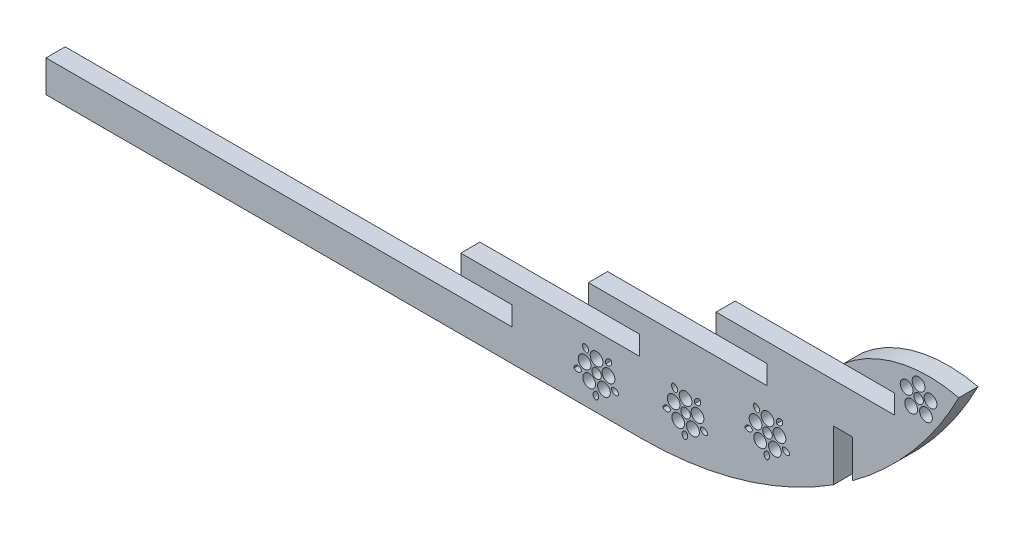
ISO-10303-21;
HEADER;
FILE_DESCRIPTION(('STEP AP214'),'2;1');
FILE_NAME('part.step','',(''),(''),'','','');
FILE_SCHEMA(('AUTOMOTIVE_DESIGN { 1 0 10303 214 1 1 1 1 }'));
ENDSEC;
DATA;
#1=APPLICATION_CONTEXT('core data for automotive mechanical design processes');
#2=APPLICATION_PROTOCOL_DEFINITION('international standard','automotive_design',2000,#1);
#3=PRODUCT_CONTEXT('',#1,'mechanical');
#4=PRODUCT('Part','Part','',(#3));
#5=PRODUCT_RELATED_PRODUCT_CATEGORY('part','',(#4));
#6=PRODUCT_DEFINITION_FORMATION('','',#4);
#7=PRODUCT_DEFINITION_CONTEXT('part definition',#1,'design');
#8=PRODUCT_DEFINITION('design','',#6,#7);
#9=PRODUCT_DEFINITION_SHAPE('','',#8);
#10=(LENGTH_UNIT() NAMED_UNIT(*) SI_UNIT(.MILLI.,.METRE.));
#11=(NAMED_UNIT(*) PLANE_ANGLE_UNIT() SI_UNIT($,.RADIAN.));
#12=(NAMED_UNIT(*) SI_UNIT($,.STERADIAN.) SOLID_ANGLE_UNIT());
#13=UNCERTAINTY_MEASURE_WITH_UNIT(LENGTH_MEASURE(1.E-05),#10,'distance_accuracy_value','');
#14=(GEOMETRIC_REPRESENTATION_CONTEXT(3) GLOBAL_UNCERTAINTY_ASSIGNED_CONTEXT((#13)) GLOBAL_UNIT_ASSIGNED_CONTEXT((#10,
#11,#12)) REPRESENTATION_CONTEXT('',''));
#15=CARTESIAN_POINT('',(0.,0.,0.));
#16=DIRECTION('',(0.,0.,1.));
#17=DIRECTION('',(1.,0.,0.));
#18=AXIS2_PLACEMENT_3D('',#15,#16,#17);
#19=CARTESIAN_POINT('',(-44.9892098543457,31.1945358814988,3.));
#20=DIRECTION('',(0.,0.,1.));
#21=DIRECTION('',(1.,0.,0.));
#22=AXIS2_PLACEMENT_3D('',#19,#20,#21);
#23=PLANE('',#22);
#24=CARTESIAN_POINT('',(-55.031569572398,-20.2518291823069,3.));
#25=DIRECTION('',(0.,0.,1.));
#26=DIRECTION('',(-1.,0.,0.));
#27=AXIS2_PLACEMENT_3D('',#24,#25,#26);
#28=CIRCLE('',#27,0.63282506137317);
#29=CARTESIAN_POINT('',(-54.4570208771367,-19.9865720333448,3.));
#30=VERTEX_POINT('',#29);
#31=CARTESIAN_POINT('',(-55.6642969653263,-20.2407114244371,3.));
#32=VERTEX_POINT('',#31);
#33=EDGE_CURVE('E387',#30,#32,#28,.T.);
#34=ORIENTED_EDGE('',*,*,#33,.F.);
#35=CARTESIAN_POINT('',(-55.124913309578,-19.8084045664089,3.));
#36=DIRECTION('',(0.,0.,1.));
#37=DIRECTION('',(-1.,0.,0.));
#38=AXIS2_PLACEMENT_3D('',#35,#36,#37);
#39=CIRCLE('',#38,0.691248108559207);
#40=EDGE_CURVE('E384',#32,#30,#39,.T.);
#41=ORIENTED_EDGE('',*,*,#40,.F.);
#42=EDGE_LOOP('',(#34,#41));
#43=FACE_BOUND('',#42,.T.);
#44=CARTESIAN_POINT('',(-49.1514376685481,-20.0798692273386,3.));
#45=DIRECTION('',(0.,0.,1.));
#46=DIRECTION('',(-1.,0.,0.));
#47=AXIS2_PLACEMENT_3D('',#44,#45,#46);
#48=CIRCLE('',#47,0.632825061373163);
#49=CARTESIAN_POINT('',(-49.7721715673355,-19.95675551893,3.));
#50=VERTEX_POINT('',#49);
#51=CARTESIAN_POINT('',(-48.646085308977,-20.4607715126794,3.));
#52=VERTEX_POINT('',#51);
#53=EDGE_CURVE('E421',#50,#52,#48,.T.);
#54=ORIENTED_EDGE('',*,*,#53,.F.);
#55=CARTESIAN_POINT('',(-49.3365594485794,-20.4934733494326,3.));
#56=DIRECTION('',(0.,0.,1.));
#57=DIRECTION('',(-1.,0.,0.));
#58=AXIS2_PLACEMENT_3D('',#55,#56,#57);
#59=CIRCLE('',#58,0.691248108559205);
#60=EDGE_CURVE('E418',#52,#50,#59,.T.);
#61=ORIENTED_EDGE('',*,*,#60,.F.);
#62=EDGE_LOOP('',(#54,#61));
#63=FACE_BOUND('',#62,.T.);
#64=CARTESIAN_POINT('',(-53.2769887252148,-20.8037927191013,3.));
#65=DIRECTION('',(0.,0.,1.));
#66=DIRECTION('',(1.,0.,0.));
#67=AXIS2_PLACEMENT_3D('',#64,#65,#66);
#68=CIRCLE('',#67,1.00000000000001);
#69=CARTESIAN_POINT('',(-52.2769887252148,-20.8037927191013,3.));
#70=VERTEX_POINT('',#69);
#71=EDGE_CURVE('E441',#70,#70,#68,.T.);
#72=ORIENTED_EDGE('',*,*,#71,.F.);
#73=EDGE_LOOP('',(#72));
#74=FACE_BOUND('',#73,.T.);
#75=CARTESIAN_POINT('',(-50.2464873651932,-18.6020045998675,3.));
#76=DIRECTION('',(0.,0.,1.));
#77=DIRECTION('',(1.,0.,0.));
#78=AXIS2_PLACEMENT_3D('',#75,#76,#77);
#79=CIRCLE('',#78,1.00000000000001);
#80=CARTESIAN_POINT('',(-49.2464873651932,-18.6020045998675,3.));
#81=VERTEX_POINT('',#80);
#82=EDGE_CURVE('E453',#81,#81,#79,.T.);
#83=ORIENTED_EDGE('',*,*,#82,.F.);
#84=EDGE_LOOP('',(#83));
#85=FACE_BOUND('',#84,.T.);
#86=CARTESIAN_POINT('',(-52.1194402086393,-17.2412247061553,3.));
#87=DIRECTION('',(0.,0.,1.));
#88=DIRECTION('',(1.,0.,0.));
#89=AXIS2_PLACEMENT_3D('',#86,#87,#88);
#90=CIRCLE('',#89,0.999999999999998);
#91=CARTESIAN_POINT('',(-51.1194402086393,-17.2412247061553,3.));
#92=VERTEX_POINT('',#91);
#93=EDGE_CURVE('E476',#92,#92,#90,.T.);
#94=ORIENTED_EDGE('',*,*,#93,.F.);
#95=EDGE_LOOP('',(#94));
#96=FACE_BOUND('',#95,.T.);
#97=CARTESIAN_POINT('',(-26.828426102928,-11.2540109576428,3.));
#98=DIRECTION('',(0.,0.,1.));
#99=DIRECTION('',(-1.,0.,0.));
#100=AXIS2_PLACEMENT_3D('',#97,#98,#99);
#101=CIRCLE('',#100,0.691248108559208);
#102=CARTESIAN_POINT('',(-27.4062530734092,-10.8746167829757,3.));
#103=VERTEX_POINT('',#102);
#104=CARTESIAN_POINT('',(-26.7914833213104,-11.9442711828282,3.));
#105=VERTEX_POINT('',#104);
#106=EDGE_CURVE('E491',#103,#105,#101,.T.);
#107=ORIENTED_EDGE('',*,*,#106,.F.);
#108=CARTESIAN_POINT('',(-27.2213031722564,-11.4798118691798,3.));
#109=DIRECTION('',(0.,0.,1.));
#110=DIRECTION('',(-1.,0.,0.));
#111=AXIS2_PLACEMENT_3D('',#108,#109,#110);
#112=CIRCLE('',#111,0.632825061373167);
#113=EDGE_CURVE('E488',#105,#103,#112,.T.);
#114=ORIENTED_EDGE('',*,*,#113,.F.);
#115=EDGE_LOOP('',(#107,#114));
#116=FACE_BOUND('',#115,.T.);
#117=CARTESIAN_POINT('',(-25.6912655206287,-16.9707605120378,3.));
#118=DIRECTION('',(0.,0.,1.));
#119=DIRECTION('',(-1.,0.,0.));
#120=AXIS2_PLACEMENT_3D('',#117,#118,#119);
#121=CIRCLE('',#120,0.691248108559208);
#122=CARTESIAN_POINT('',(-25.4467959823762,-17.6173350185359,3.));
#123=VERTEX_POINT('',#122);
#124=CARTESIAN_POINT('',(-25.3154280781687,-16.3906138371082,3.));
#125=VERTEX_POINT('',#124);
#126=EDGE_CURVE('E525',#123,#125,#121,.T.);
#127=ORIENTED_EDGE('',*,*,#126,.F.);
#128=CARTESIAN_POINT('',(-25.2406988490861,-17.0190110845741,3.));
#129=DIRECTION('',(0.,0.,1.));
#130=DIRECTION('',(-1.,0.,0.));
#131=AXIS2_PLACEMENT_3D('',#128,#129,#130);
#132=CIRCLE('',#131,0.632825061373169);
#133=EDGE_CURVE('E522',#125,#123,#132,.T.);
#134=ORIENTED_EDGE('',*,*,#133,.F.);
#135=EDGE_LOOP('',(#127,#134));
#136=FACE_BOUND('',#135,.T.);
#137=CARTESIAN_POINT('',(-27.2040563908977,-13.3190835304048,3.));
#138=DIRECTION('',(0.,0.,1.));
#139=DIRECTION('',(1.,0.,0.));
#140=AXIS2_PLACEMENT_3D('',#137,#138,#139);
#141=CIRCLE('',#140,0.999999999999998);
#142=CARTESIAN_POINT('',(-26.2040563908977,-13.3190835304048,3.));
#143=VERTEX_POINT('',#142);
#144=EDGE_CURVE('E556',#143,#143,#141,.T.);
#145=ORIENTED_EDGE('',*,*,#144,.F.);
#146=EDGE_LOOP('',(#145));
#147=FACE_BOUND('',#146,.T.);
#148=CARTESIAN_POINT('',(-24.173555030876,-15.5208716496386,3.));
#149=DIRECTION('',(0.,0.,1.));
#150=DIRECTION('',(1.,0.,0.));
#151=AXIS2_PLACEMENT_3D('',#148,#149,#150);
#152=CIRCLE('',#151,0.999999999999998);
#153=CARTESIAN_POINT('',(-23.173555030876,-15.5208716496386,3.));
#154=VERTEX_POINT('',#153);
#155=EDGE_CURVE('E568',#154,#154,#152,.T.);
#156=ORIENTED_EDGE('',*,*,#155,.F.);
#157=EDGE_LOOP('',(#156));
#158=FACE_BOUND('',#157,.T.);
#159=CARTESIAN_POINT('',(-23.2510266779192,-11.6774067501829,3.));
#160=DIRECTION('',(0.,0.,1.));
#161=DIRECTION('',(-1.,0.,0.));
#162=AXIS2_PLACEMENT_3D('',#159,#160,#161);
#163=CIRCLE('',#162,0.691248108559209);
#164=CARTESIAN_POINT('',(-23.0687597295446,-11.0106213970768,3.));
#165=VERTEX_POINT('',#164);
#166=CARTESIAN_POINT('',(-23.8960872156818,-11.9258435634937,3.));
#167=VERTEX_POINT('',#166);
#168=EDGE_CURVE('E583',#165,#167,#163,.T.);
#169=ORIENTED_EDGE('',*,*,#168,.F.);
#170=CARTESIAN_POINT('',(-23.5871817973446,-11.3735347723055,3.));
#171=DIRECTION('',(0.,0.,1.));
#172=DIRECTION('',(-1.,0.,0.));
#173=AXIS2_PLACEMENT_3D('',#170,#171,#172);
#174=CIRCLE('',#173,0.632825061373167);
#175=EDGE_CURVE('E580',#167,#165,#174,.T.);
#176=ORIENTED_EDGE('',*,*,#175,.F.);
#177=EDGE_LOOP('',(#169,#176));
#178=FACE_BOUND('',#177,.T.);
#179=CARTESIAN_POINT('',(-25.3311035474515,-13.9276427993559,3.));
#180=DIRECTION('',(0.,0.,1.));
#181=DIRECTION('',(1.,0.,0.));
#182=AXIS2_PLACEMENT_3D('',#179,#180,#181);
#183=CIRCLE('',#182,0.749999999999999);
#184=CARTESIAN_POINT('',(-24.5811035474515,-13.9276427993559,3.));
#185=VERTEX_POINT('',#184);
#186=EDGE_CURVE('E603',#185,#185,#183,.T.);
#187=ORIENTED_EDGE('',*,*,#186,.F.);
#188=EDGE_LOOP('',(#187));
#189=FACE_BOUND('',#188,.T.);
#190=CARTESIAN_POINT('',(-41.1765668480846,-18.2151757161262,3.));
#191=DIRECTION('',(0.,0.,1.));
#192=DIRECTION('',(-1.,0.,0.));
#193=AXIS2_PLACEMENT_3D('',#190,#191,#192);
#194=CIRCLE('',#193,0.691248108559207);
#195=CARTESIAN_POINT('',(-41.715950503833,-18.6474825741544,3.));
#196=VERTEX_POINT('',#195);
#197=CARTESIAN_POINT('',(-40.5086744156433,-18.3933431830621,3.));
#198=VERTEX_POINT('',#197);
#199=EDGE_CURVE('E629',#196,#198,#194,.T.);
#200=ORIENTED_EDGE('',*,*,#199,.F.);
#201=CARTESIAN_POINT('',(-41.0832231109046,-18.6586003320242,3.));
#202=DIRECTION('',(0.,0.,1.));
#203=DIRECTION('',(-1.,0.,0.));
#204=AXIS2_PLACEMENT_3D('',#201,#202,#203);
#205=CIRCLE('',#204,0.63282506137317);
#206=EDGE_CURVE('E626',#198,#196,#205,.T.);
#207=ORIENTED_EDGE('',*,*,#206,.F.);
#208=EDGE_LOOP('',(#200,#207));
#209=FACE_BOUND('',#208,.T.);
#210=CARTESIAN_POINT('',(-35.388212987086,-18.9002444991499,3.));
#211=DIRECTION('',(0.,0.,1.));
#212=DIRECTION('',(-1.,0.,0.));
#213=AXIS2_PLACEMENT_3D('',#210,#211,#212);
#214=CIRCLE('',#213,0.691248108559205);
#215=CARTESIAN_POINT('',(-34.6977388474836,-18.8675426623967,3.));
#216=VERTEX_POINT('',#215);
#217=CARTESIAN_POINT('',(-35.8238251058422,-18.3635266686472,3.));
#218=VERTEX_POINT('',#217);
#219=EDGE_CURVE('E663',#216,#218,#214,.T.);
#220=ORIENTED_EDGE('',*,*,#219,.F.);
#221=CARTESIAN_POINT('',(-35.2030912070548,-18.4866403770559,3.));
#222=DIRECTION('',(0.,0.,1.));
#223=DIRECTION('',(-1.,0.,0.));
#224=AXIS2_PLACEMENT_3D('',#221,#222,#223);
#225=CIRCLE('',#224,0.632825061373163);
#226=EDGE_CURVE('E660',#218,#216,#225,.T.);
#227=ORIENTED_EDGE('',*,*,#226,.F.);
#228=EDGE_LOOP('',(#220,#227));
#229=FACE_BOUND('',#228,.T.);
#230=CARTESIAN_POINT('',(-39.3286422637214,-19.2105638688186,3.));
#231=DIRECTION('',(0.,0.,1.));
#232=DIRECTION('',(1.,0.,0.));
#233=AXIS2_PLACEMENT_3D('',#230,#231,#232);
#234=CIRCLE('',#233,1.00000000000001);
#235=CARTESIAN_POINT('',(-38.3286422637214,-19.2105638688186,3.));
#236=VERTEX_POINT('',#235);
#237=EDGE_CURVE('E683',#236,#236,#234,.T.);
#238=ORIENTED_EDGE('',*,*,#237,.F.);
#239=EDGE_LOOP('',(#238));
#240=FACE_BOUND('',#239,.T.);
#241=CARTESIAN_POINT('',(-36.2981409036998,-17.0087757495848,3.));
#242=DIRECTION('',(0.,0.,1.));
#243=DIRECTION('',(1.,0.,0.));
#244=AXIS2_PLACEMENT_3D('',#241,#242,#243);
#245=CIRCLE('',#244,1.00000000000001);
#246=CARTESIAN_POINT('',(-35.2981409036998,-17.0087757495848,3.));
#247=VERTEX_POINT('',#246);
#248=EDGE_CURVE('E695',#247,#247,#245,.T.);
#249=ORIENTED_EDGE('',*,*,#248,.F.);
#250=EDGE_LOOP('',(#249));
#251=FACE_BOUND('',#250,.T.);
#252=CARTESIAN_POINT('',(-38.171093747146,-15.6479958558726,3.));
#253=DIRECTION('',(0.,0.,1.));
#254=DIRECTION('',(1.,0.,0.));
#255=AXIS2_PLACEMENT_3D('',#252,#253,#254);
#256=CIRCLE('',#255,0.999999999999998);
#257=CARTESIAN_POINT('',(-37.171093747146,-15.6479958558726,3.));
#258=VERTEX_POINT('',#257);
#259=EDGE_CURVE('E718',#258,#258,#256,.T.);
#260=ORIENTED_EDGE('',*,*,#259,.F.);
#261=EDGE_LOOP('',(#260));
#262=FACE_BOUND('',#261,.T.);
#263=CARTESIAN_POINT('',(-2.81702485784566,1.00069629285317,3.));
#264=DIRECTION('',(0.,0.,1.));
#265=DIRECTION('',(1.,0.,0.));
#266=AXIS2_PLACEMENT_3D('',#263,#264,#265);
#267=CIRCLE('',#266,0.999999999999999);
#268=CARTESIAN_POINT('',(-1.81702485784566,1.00069629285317,3.));
#269=VERTEX_POINT('',#268);
#270=EDGE_CURVE('E730',#269,#269,#267,.T.);
#271=ORIENTED_EDGE('',*,*,#270,.F.);
#272=EDGE_LOOP('',(#271));
#273=FACE_BOUND('',#272,.T.);
#274=CARTESIAN_POINT('',(0.213476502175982,3.20248441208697,3.));
#275=DIRECTION('',(0.,0.,1.));
#276=DIRECTION('',(1.,0.,0.));
#277=AXIS2_PLACEMENT_3D('',#274,#275,#276);
#278=CIRCLE('',#277,1.);
#279=CARTESIAN_POINT('',(1.21347650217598,3.20248441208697,3.));
#280=VERTEX_POINT('',#279);
#281=EDGE_CURVE('E742',#280,#280,#278,.T.);
#282=ORIENTED_EDGE('',*,*,#281,.F.);
#283=EDGE_LOOP('',(#282));
#284=FACE_BOUND('',#283,.T.);
#285=CARTESIAN_POINT('',(-38.171093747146,-17.6173350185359,3.));
#286=DIRECTION('',(0.,0.,1.));
#287=DIRECTION('',(1.,0.,0.));
#288=AXIS2_PLACEMENT_3D('',#285,#286,#287);
#289=CIRCLE('',#288,0.749999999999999);
#290=CARTESIAN_POINT('',(-37.421093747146,-17.6173350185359,3.));
#291=VERTEX_POINT('',#290);
#292=EDGE_CURVE('E754',#291,#291,#289,.T.);
#293=ORIENTED_EDGE('',*,*,#292,.F.);
#294=EDGE_LOOP('',(#293));
#295=FACE_BOUND('',#294,.T.);
#296=DIRECTION('',(0.,-1.,0.));
#297=VECTOR('',#296,1.);
#298=CARTESIAN_POINT('',(-33.3989367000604,-1.53836890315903,3.));
#299=LINE('',#298,#297);
#300=CARTESIAN_POINT('',(-33.3989367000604,-1.53836890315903,3.));
#301=VERTEX_POINT('',#300);
#302=CARTESIAN_POINT('',(-33.3989367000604,-4.53836890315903,3.));
#303=VERTEX_POINT('',#302);
#304=EDGE_CURVE('E766',#301,#303,#299,.T.);
#305=ORIENTED_EDGE('',*,*,#304,.T.);
#306=DIRECTION('',(1.,0.,0.));
#307=VECTOR('',#306,1.);
#308=CARTESIAN_POINT('',(-33.3989367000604,-4.53836890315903,3.));
#309=LINE('',#308,#307);
#310=CARTESIAN_POINT('',(-25.3989367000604,-4.53836890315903,3.));
#311=VERTEX_POINT('',#310);
#312=EDGE_CURVE('E769',#303,#311,#309,.T.);
#313=ORIENTED_EDGE('',*,*,#312,.T.);
#314=DIRECTION('',(0.,-1.,0.));
#315=VECTOR('',#314,1.);
#316=CARTESIAN_POINT('',(-25.3989367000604,-4.53836890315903,3.));
#317=LINE('',#316,#315);
#318=CARTESIAN_POINT('',(-25.3989367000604,-7.53836890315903,3.));
#319=VERTEX_POINT('',#318);
#320=EDGE_CURVE('E772',#311,#319,#317,.T.);
#321=ORIENTED_EDGE('',*,*,#320,.T.);
#322=DIRECTION('',(-1.,0.,0.));
#323=VECTOR('',#322,1.);
#324=CARTESIAN_POINT('',(-53.3989367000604,-7.53836890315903,3.));
#325=LINE('',#324,#323);
#326=CARTESIAN_POINT('',(-53.3989367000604,-7.53836890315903,3.));
#327=VERTEX_POINT('',#326);
#328=EDGE_CURVE('E774',#319,#327,#325,.T.);
#329=ORIENTED_EDGE('',*,*,#328,.T.);
#330=DIRECTION('',(0.,-1.,0.));
#331=VECTOR('',#330,1.);
#332=CARTESIAN_POINT('',(-53.3989367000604,-7.53836890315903,3.));
#333=LINE('',#332,#331);
#334=CARTESIAN_POINT('',(-53.3989367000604,-10.538368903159,3.));
#335=VERTEX_POINT('',#334);
#336=EDGE_CURVE('E776',#327,#335,#333,.T.);
#337=ORIENTED_EDGE('',*,*,#336,.T.);
#338=DIRECTION('',(1.,0.,0.));
#339=VECTOR('',#338,1.);
#340=CARTESIAN_POINT('',(-53.3989367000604,-10.538368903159,3.));
#341=LINE('',#340,#339);
#342=CARTESIAN_POINT('',(-45.3989367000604,-10.538368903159,3.));
#343=VERTEX_POINT('',#342);
#344=EDGE_CURVE('E778',#335,#343,#341,.T.);
#345=ORIENTED_EDGE('',*,*,#344,.T.);
#346=DIRECTION('',(0.,-1.,0.));
#347=VECTOR('',#346,1.);
#348=CARTESIAN_POINT('',(-45.3989367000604,-10.538368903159,3.));
#349=LINE('',#348,#347);
#350=CARTESIAN_POINT('',(-45.3989367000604,-13.538368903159,3.));
#351=VERTEX_POINT('',#350);
#352=EDGE_CURVE('E780',#343,#351,#349,.T.);
#353=ORIENTED_EDGE('',*,*,#352,.T.);
#354=DIRECTION('',(-1.,0.,0.));
#355=VECTOR('',#354,1.);
#356=CARTESIAN_POINT('',(-73.3989367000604,-13.538368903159,3.));
#357=LINE('',#356,#355);
#358=CARTESIAN_POINT('',(-73.3989367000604,-13.538368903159,3.));
#359=VERTEX_POINT('',#358);
#360=EDGE_CURVE('E782',#351,#359,#357,.T.);
#361=ORIENTED_EDGE('',*,*,#360,.T.);
#362=DIRECTION('',(0.,-1.,0.));
#363=VECTOR('',#362,1.);
#364=CARTESIAN_POINT('',(-73.3989367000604,-13.538368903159,3.));
#365=LINE('',#364,#363);
#366=CARTESIAN_POINT('',(-73.3989367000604,-16.538368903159,3.));
#367=VERTEX_POINT('',#366);
#368=EDGE_CURVE('E784',#359,#367,#365,.T.);
#369=ORIENTED_EDGE('',*,*,#368,.T.);
#370=DIRECTION('',(1.,0.,0.));
#371=VECTOR('',#370,1.);
#372=CARTESIAN_POINT('',(-73.3989367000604,-16.538368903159,3.));
#373=LINE('',#372,#371);
#374=CARTESIAN_POINT('',(-65.3989367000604,-16.538368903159,3.));
#375=VERTEX_POINT('',#374);
#376=EDGE_CURVE('E786',#367,#375,#373,.T.);
#377=ORIENTED_EDGE('',*,*,#376,.T.);
#378=DIRECTION('',(0.,-1.,0.));
#379=VECTOR('',#378,1.);
#380=CARTESIAN_POINT('',(-65.3989367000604,-16.538368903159,3.));
#381=LINE('',#380,#379);
#382=CARTESIAN_POINT('',(-65.3989367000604,-19.538368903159,3.));
#383=VERTEX_POINT('',#382);
#384=EDGE_CURVE('E788',#375,#383,#381,.T.);
#385=ORIENTED_EDGE('',*,*,#384,.T.);
#386=DIRECTION('',(-1.,0.,0.));
#387=VECTOR('',#386,1.);
#388=CARTESIAN_POINT('',(-138.39893670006,-19.538368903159,3.));
#389=LINE('',#388,#387);
#390=CARTESIAN_POINT('',(-138.39893670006,-19.538368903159,3.));
#391=VERTEX_POINT('',#390);
#392=EDGE_CURVE('E790',#383,#391,#389,.T.);
#393=ORIENTED_EDGE('',*,*,#392,.T.);
#394=DIRECTION('',(0.,-1.,0.));
#395=VECTOR('',#394,1.);
#396=CARTESIAN_POINT('',(-138.39893670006,-19.538368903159,3.));
#397=LINE('',#396,#395);
#398=CARTESIAN_POINT('',(-138.39893670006,-24.538368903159,3.));
#399=VERTEX_POINT('',#398);
#400=EDGE_CURVE('E792',#391,#399,#397,.T.);
#401=ORIENTED_EDGE('',*,*,#400,.T.);
#402=DIRECTION('',(1.,0.,0.));
#403=VECTOR('',#402,1.);
#404=CARTESIAN_POINT('',(-138.39893670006,-24.538368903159,3.));
#405=LINE('',#404,#403);
#406=CARTESIAN_POINT('',(-44.9892098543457,-24.538368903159,3.));
#407=VERTEX_POINT('',#406);
#408=EDGE_CURVE('E794',#399,#407,#405,.T.);
#409=ORIENTED_EDGE('',*,*,#408,.T.);
#410=CARTESIAN_POINT('',(-44.9892098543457,31.1945358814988,3.));
#411=DIRECTION('',(0.,0.,1.));
#412=DIRECTION('',(1.,0.,0.));
#413=AXIS2_PLACEMENT_3D('',#410,#411,#412);
#414=CIRCLE('',#413,55.7329047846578);
#415=CARTESIAN_POINT('',(-15.015629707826,-15.7920703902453,3.));
#416=VERTEX_POINT('',#415);
#417=EDGE_CURVE('E796',#407,#416,#414,.T.);
#418=ORIENTED_EDGE('',*,*,#417,.T.);
#419=DIRECTION('',(-2.46089254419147E-05,0.999999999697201,0.));
#420=VECTOR('',#419,1.);
#421=CARTESIAN_POINT('',(-15.0158265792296,-7.79207039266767,3.));
#422=LINE('',#421,#420);
#423=CARTESIAN_POINT('',(-15.0158265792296,-7.79207039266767,3.));
#424=VERTEX_POINT('',#423);
#425=EDGE_CURVE('E798',#416,#424,#422,.T.);
#426=ORIENTED_EDGE('',*,*,#425,.T.);
#427=DIRECTION('',(1.,0.,0.));
#428=VECTOR('',#427,1.);
#429=CARTESIAN_POINT('',(-15.0158265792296,-7.79207039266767,3.));
#430=LINE('',#429,#428);
#431=CARTESIAN_POINT('',(-12.0158265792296,-7.79207039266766,3.));
#432=VERTEX_POINT('',#431);
#433=EDGE_CURVE('E800',#424,#432,#430,.T.);
#434=ORIENTED_EDGE('',*,*,#433,.T.);
#435=DIRECTION('',(2.46089254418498E-05,-0.9999999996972,0.));
#436=VECTOR('',#435,1.);
#437=CARTESIAN_POINT('',(-12.0158265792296,-7.79207039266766,3.));
#438=LINE('',#437,#436);
#439=CARTESIAN_POINT('',(-12.0156802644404,-13.7376688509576,3.));
#440=VERTEX_POINT('',#439);
#441=EDGE_CURVE('E802',#432,#440,#438,.T.);
#442=ORIENTED_EDGE('',*,*,#441,.T.);
#443=CARTESIAN_POINT('',(-44.9892098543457,31.1945358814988,3.));
#444=DIRECTION('',(0.,0.,1.));
#445=DIRECTION('',(1.,0.,0.));
#446=AXIS2_PLACEMENT_3D('',#443,#444,#445);
#447=CIRCLE('',#446,55.7329047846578);
#448=CARTESIAN_POINT('',(4.65457694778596,5.86370273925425,3.));
#449=VERTEX_POINT('',#448);
#450=EDGE_CURVE('E804',#440,#449,#447,.T.);
#451=ORIENTED_EDGE('',*,*,#450,.T.);
#452=CARTESIAN_POINT('',(-0.0601139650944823,-14.0217205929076,3.));
#453=DIRECTION('',(0.,0.,1.));
#454=DIRECTION('',(-1.,0.,0.));
#455=AXIS2_PLACEMENT_3D('',#452,#453,#454);
#456=CIRCLE('',#455,20.4366917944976);
#457=CARTESIAN_POINT('',(-13.3989367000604,1.46163109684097,3.));
#458=VERTEX_POINT('',#457);
#459=EDGE_CURVE('E806',#449,#458,#456,.T.);
#460=ORIENTED_EDGE('',*,*,#459,.T.);
#461=DIRECTION('',(1.,0.,0.));
#462=VECTOR('',#461,1.);
#463=CARTESIAN_POINT('',(-5.39893670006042,1.46163109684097,3.));
#464=LINE('',#463,#462);
#465=CARTESIAN_POINT('',(-5.39893670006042,1.46163109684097,3.));
#466=VERTEX_POINT('',#465);
#467=EDGE_CURVE('E808',#458,#466,#464,.T.);
#468=ORIENTED_EDGE('',*,*,#467,.T.);
#469=DIRECTION('',(0.,-1.,0.));
#470=VECTOR('',#469,1.);
#471=CARTESIAN_POINT('',(-5.39893670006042,1.46163109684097,3.));
#472=LINE('',#471,#470);
#473=CARTESIAN_POINT('',(-5.39893670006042,-1.53836890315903,3.));
#474=VERTEX_POINT('',#473);
#475=EDGE_CURVE('E810',#466,#474,#472,.T.);
#476=ORIENTED_EDGE('',*,*,#475,.T.);
#477=DIRECTION('',(-1.,0.,0.));
#478=VECTOR('',#477,1.);
#479=CARTESIAN_POINT('',(-33.3989367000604,-1.53836890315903,3.));
#480=LINE('',#479,#478);
#481=EDGE_CURVE('E812',#474,#301,#480,.T.);
#482=ORIENTED_EDGE('',*,*,#481,.T.);
#483=EDGE_LOOP('',(#305,#313,#321,#329,#337,#345,#353,#361,#369,#377,#385,#393,#401,#409,#418,
#426,#434,#442,#451,#460,#468,#476,#482));
#484=FACE_BOUND('',#483,.T.);
#485=CARTESIAN_POINT('',(-1.65947634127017,2.59392514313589,3.));
#486=DIRECTION('',(0.,0.,1.));
#487=DIRECTION('',(1.,0.,0.));
#488=AXIS2_PLACEMENT_3D('',#485,#486,#487);
#489=CIRCLE('',#488,0.75);
#490=CARTESIAN_POINT('',(-0.909476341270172,2.59392514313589,3.));
#491=VERTEX_POINT('',#490);
#492=EDGE_CURVE('E760',#491,#491,#489,.T.);
#493=ORIENTED_EDGE('',*,*,#492,.F.);
#494=EDGE_LOOP('',(#493));
#495=FACE_BOUND('',#494,.T.);
#496=CARTESIAN_POINT('',(-1.65947634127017,4.56326430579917,3.));
#497=DIRECTION('',(0.,0.,1.));
#498=DIRECTION('',(1.,0.,0.));
#499=AXIS2_PLACEMENT_3D('',#496,#497,#498);
#500=CIRCLE('',#499,1.);
#501=CARTESIAN_POINT('',(-0.65947634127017,4.56326430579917,3.));
#502=VERTEX_POINT('',#501);
#503=EDGE_CURVE('E748',#502,#502,#500,.T.);
#504=ORIENTED_EDGE('',*,*,#503,.F.);
#505=EDGE_LOOP('',(#504));
#506=FACE_BOUND('',#505,.T.);
#507=CARTESIAN_POINT('',(-0.501927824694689,1.00069629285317,3.));
#508=DIRECTION('',(0.,0.,1.));
#509=DIRECTION('',(1.,0.,0.));
#510=AXIS2_PLACEMENT_3D('',#507,#508,#509);
#511=CIRCLE('',#510,1.);
#512=CARTESIAN_POINT('',(0.498072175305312,1.00069629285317,3.));
#513=VERTEX_POINT('',#512);
#514=EDGE_CURVE('E736',#513,#513,#511,.T.);
#515=ORIENTED_EDGE('',*,*,#514,.F.);
#516=EDGE_LOOP('',(#515));
#517=FACE_BOUND('',#516,.T.);
#518=CARTESIAN_POINT('',(-3.53242918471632,3.20248441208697,3.));
#519=DIRECTION('',(0.,0.,1.));
#520=DIRECTION('',(1.,0.,0.));
#521=AXIS2_PLACEMENT_3D('',#518,#519,#520);
#522=CIRCLE('',#521,1.);
#523=CARTESIAN_POINT('',(-2.53242918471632,3.20248441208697,3.));
#524=VERTEX_POINT('',#523);
#525=EDGE_CURVE('E724',#524,#524,#522,.T.);
#526=ORIENTED_EDGE('',*,*,#525,.F.);
#527=EDGE_LOOP('',(#526));
#528=FACE_BOUND('',#527,.T.);
#529=CARTESIAN_POINT('',(-36.0910168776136,-15.3670989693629,3.));
#530=DIRECTION('',(0.,0.,1.));
#531=DIRECTION('',(-1.,0.,0.));
#532=AXIS2_PLACEMENT_3D('',#529,#530,#531);
#533=CIRCLE('',#532,0.691248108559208);
#534=CARTESIAN_POINT('',(-35.908749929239,-14.7003136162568,3.));
#535=VERTEX_POINT('',#534);
#536=CARTESIAN_POINT('',(-36.7360774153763,-15.6155357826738,3.));
#537=VERTEX_POINT('',#536);
#538=EDGE_CURVE('E704',#535,#537,#533,.T.);
#539=ORIENTED_EDGE('',*,*,#538,.F.);
#540=CARTESIAN_POINT('',(-36.427171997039,-15.0632269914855,3.));
#541=DIRECTION('',(0.,0.,1.));
#542=DIRECTION('',(-1.,0.,0.));
#543=AXIS2_PLACEMENT_3D('',#540,#541,#542);
#544=CIRCLE('',#543,0.632825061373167);
#545=EDGE_CURVE('E701',#537,#535,#544,.T.);
#546=ORIENTED_EDGE('',*,*,#545,.F.);
#547=EDGE_LOOP('',(#539,#546));
#548=FACE_BOUND('',#547,.T.);
#549=CARTESIAN_POINT('',(-37.0135452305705,-19.2105638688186,3.));
#550=DIRECTION('',(0.,0.,1.));
#551=DIRECTION('',(1.,0.,0.));
#552=AXIS2_PLACEMENT_3D('',#549,#550,#551);
#553=CIRCLE('',#552,0.999999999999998);
#554=CARTESIAN_POINT('',(-36.0135452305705,-19.2105638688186,3.));
#555=VERTEX_POINT('',#554);
#556=EDGE_CURVE('E689',#555,#555,#553,.T.);
#557=ORIENTED_EDGE('',*,*,#556,.F.);
#558=EDGE_LOOP('',(#557));
#559=FACE_BOUND('',#558,.T.);
#560=CARTESIAN_POINT('',(-40.0440465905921,-17.0087757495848,3.));
#561=DIRECTION('',(0.,0.,1.));
#562=DIRECTION('',(1.,0.,0.));
#563=AXIS2_PLACEMENT_3D('',#560,#561,#562);
#564=CIRCLE('',#563,0.999999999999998);
#565=CARTESIAN_POINT('',(-39.0440465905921,-17.0087757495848,3.));
#566=VERTEX_POINT('',#565);
#567=EDGE_CURVE('E677',#566,#566,#564,.T.);
#568=ORIENTED_EDGE('',*,*,#567,.F.);
#569=EDGE_LOOP('',(#568));
#570=FACE_BOUND('',#569,.T.);
#571=CARTESIAN_POINT('',(-38.0806890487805,-20.7087033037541,3.));
#572=DIRECTION('',(0.,0.,1.));
#573=DIRECTION('',(-1.,0.,0.));
#574=AXIS2_PLACEMENT_3D('',#571,#572,#573);
#575=CIRCLE('',#574,0.632825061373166);
#576=CARTESIAN_POINT('',(-38.1554182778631,-20.0803060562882,3.));
#577=VERTEX_POINT('',#576);
#578=CARTESIAN_POINT('',(-38.2867861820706,-21.3070272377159,3.));
#579=VERTEX_POINT('',#578);
#580=EDGE_CURVE('E646',#577,#579,#575,.T.);
#581=ORIENTED_EDGE('',*,*,#580,.F.);
#582=CARTESIAN_POINT('',(-38.5312557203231,-20.6604527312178,3.));
#583=DIRECTION('',(0.,0.,1.));
#584=DIRECTION('',(-1.,0.,0.));
#585=AXIS2_PLACEMENT_3D('',#582,#583,#584);
#586=CIRCLE('',#585,0.691248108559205);
#587=EDGE_CURVE('E643',#579,#577,#586,.T.);
#588=ORIENTED_EDGE('',*,*,#587,.F.);
#589=EDGE_LOOP('',(#581,#588));
#590=FACE_BOUND('',#589,.T.);
#591=CARTESIAN_POINT('',(-39.6684163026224,-14.9437031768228,3.));
#592=DIRECTION('',(0.,0.,1.));
#593=DIRECTION('',(-1.,0.,0.));
#594=AXIS2_PLACEMENT_3D('',#591,#592,#593);
#595=CIRCLE('',#594,0.691248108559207);
#596=CARTESIAN_POINT('',(-40.2462432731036,-14.5643090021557,3.));
#597=VERTEX_POINT('',#596);
#598=CARTESIAN_POINT('',(-39.6314735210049,-15.6339634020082,3.));
#599=VERTEX_POINT('',#598);
#600=EDGE_CURVE('E612',#597,#599,#595,.T.);
#601=ORIENTED_EDGE('',*,*,#600,.F.);
#602=CARTESIAN_POINT('',(-40.0612933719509,-15.1695040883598,3.));
#603=DIRECTION('',(0.,0.,1.));
#604=DIRECTION('',(-1.,0.,0.));
#605=AXIS2_PLACEMENT_3D('',#602,#603,#604);
#606=CIRCLE('',#605,0.632825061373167);
#607=EDGE_CURVE('E609',#599,#597,#606,.T.);
#608=ORIENTED_EDGE('',*,*,#607,.F.);
#609=EDGE_LOOP('',(#601,#608));
#610=FACE_BOUND('',#609,.T.);
#611=CARTESIAN_POINT('',(-25.3311035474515,-11.9583036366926,3.));
#612=DIRECTION('',(0.,0.,1.));
#613=DIRECTION('',(1.,0.,0.));
#614=AXIS2_PLACEMENT_3D('',#611,#612,#613);
#615=CIRCLE('',#614,0.999999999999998);
#616=CARTESIAN_POINT('',(-24.3311035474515,-11.9583036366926,3.));
#617=VERTEX_POINT('',#616);
#618=EDGE_CURVE('E597',#617,#617,#615,.T.);
#619=ORIENTED_EDGE('',*,*,#618,.F.);
#620=EDGE_LOOP('',(#619));
#621=FACE_BOUND('',#620,.T.);
#622=CARTESIAN_POINT('',(-23.4581507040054,-13.3190835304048,3.));
#623=DIRECTION('',(0.,0.,1.));
#624=DIRECTION('',(1.,0.,0.));
#625=AXIS2_PLACEMENT_3D('',#622,#623,#624);
#626=CIRCLE('',#625,1.00000000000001);
#627=CARTESIAN_POINT('',(-22.4581507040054,-13.3190835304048,3.));
#628=VERTEX_POINT('',#627);
#629=EDGE_CURVE('E574',#628,#628,#626,.T.);
#630=ORIENTED_EDGE('',*,*,#629,.F.);
#631=EDGE_LOOP('',(#630));
#632=FACE_BOUND('',#631,.T.);
#633=CARTESIAN_POINT('',(-26.488652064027,-15.5208716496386,3.));
#634=DIRECTION('',(0.,0.,1.));
#635=DIRECTION('',(1.,0.,0.));
#636=AXIS2_PLACEMENT_3D('',#633,#634,#635);
#637=CIRCLE('',#636,1.);
#638=CARTESIAN_POINT('',(-25.488652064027,-15.5208716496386,3.));
#639=VERTEX_POINT('',#638);
#640=EDGE_CURVE('E562',#639,#639,#637,.T.);
#641=ORIENTED_EDGE('',*,*,#640,.F.);
#642=EDGE_LOOP('',(#641));
#643=FACE_BOUND('',#642,.T.);
#644=CARTESIAN_POINT('',(-22.3631010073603,-14.7969481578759,3.));
#645=DIRECTION('',(0.,0.,1.));
#646=DIRECTION('',(-1.,0.,0.));
#647=AXIS2_PLACEMENT_3D('',#644,#645,#646);
#648=CIRCLE('',#647,0.632825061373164);
#649=CARTESIAN_POINT('',(-22.9838349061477,-14.6738344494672,3.));
#650=VERTEX_POINT('',#649);
#651=CARTESIAN_POINT('',(-21.8577486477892,-15.1778504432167,3.));
#652=VERTEX_POINT('',#651);
#653=EDGE_CURVE('E542',#650,#652,#648,.T.);
#654=ORIENTED_EDGE('',*,*,#653,.F.);
#655=CARTESIAN_POINT('',(-22.5482227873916,-15.2105522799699,3.));
#656=DIRECTION('',(0.,0.,1.));
#657=DIRECTION('',(-1.,0.,0.));
#658=AXIS2_PLACEMENT_3D('',#655,#656,#657);
#659=CIRCLE('',#658,0.691248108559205);
#660=EDGE_CURVE('E539',#652,#650,#659,.T.);
#661=ORIENTED_EDGE('',*,*,#660,.F.);
#662=EDGE_LOOP('',(#654,#661));
#663=FACE_BOUND('',#662,.T.);
#664=CARTESIAN_POINT('',(-28.3365766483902,-14.5254834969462,3.));
#665=DIRECTION('',(0.,0.,1.));
#666=DIRECTION('',(-1.,0.,0.));
#667=AXIS2_PLACEMENT_3D('',#664,#665,#666);
#668=CIRCLE('',#667,0.691248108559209);
#669=CARTESIAN_POINT('',(-28.8759603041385,-14.9577903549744,3.));
#670=VERTEX_POINT('',#669);
#671=CARTESIAN_POINT('',(-27.6686842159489,-14.7036509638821,3.));
#672=VERTEX_POINT('',#671);
#673=EDGE_CURVE('E508',#670,#672,#668,.T.);
#674=ORIENTED_EDGE('',*,*,#673,.F.);
#675=CARTESIAN_POINT('',(-28.2432329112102,-14.9689081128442,3.));
#676=DIRECTION('',(0.,0.,1.));
#677=DIRECTION('',(-1.,0.,0.));
#678=AXIS2_PLACEMENT_3D('',#675,#676,#677);
#679=CIRCLE('',#678,0.632825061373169);
#680=EDGE_CURVE('E505',#672,#670,#679,.T.);
#681=ORIENTED_EDGE('',*,*,#680,.F.);
#682=EDGE_LOOP('',(#674,#681));
#683=FACE_BOUND('',#682,.T.);
#684=CARTESIAN_POINT('',(-52.1194402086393,-19.2105638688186,3.));
#685=DIRECTION('',(0.,0.,1.));
#686=DIRECTION('',(1.,0.,0.));
#687=AXIS2_PLACEMENT_3D('',#684,#685,#686);
#688=CIRCLE('',#687,0.749999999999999);
#689=CARTESIAN_POINT('',(-51.3694402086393,-19.2105638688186,3.));
#690=VERTEX_POINT('',#689);
#691=EDGE_CURVE('E482',#690,#690,#688,.T.);
#692=ORIENTED_EDGE('',*,*,#691,.F.);
#693=EDGE_LOOP('',(#692));
#694=FACE_BOUND('',#693,.T.);
#695=CARTESIAN_POINT('',(-50.039363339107,-16.9603278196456,3.));
#696=DIRECTION('',(0.,0.,1.));
#697=DIRECTION('',(-1.,0.,0.));
#698=AXIS2_PLACEMENT_3D('',#695,#696,#697);
#699=CIRCLE('',#698,0.691248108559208);
#700=CARTESIAN_POINT('',(-49.8570963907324,-16.2935424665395,3.));
#701=VERTEX_POINT('',#700);
#702=CARTESIAN_POINT('',(-50.6844238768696,-17.2087646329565,3.));
#703=VERTEX_POINT('',#702);
#704=EDGE_CURVE('E462',#701,#703,#699,.T.);
#705=ORIENTED_EDGE('',*,*,#704,.F.);
#706=CARTESIAN_POINT('',(-50.3755184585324,-16.6564558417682,3.));
#707=DIRECTION('',(0.,0.,1.));
#708=DIRECTION('',(-1.,0.,0.));
#709=AXIS2_PLACEMENT_3D('',#706,#707,#708);
#710=CIRCLE('',#709,0.632825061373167);
#711=EDGE_CURVE('E459',#703,#701,#710,.T.);
#712=ORIENTED_EDGE('',*,*,#711,.F.);
#713=EDGE_LOOP('',(#705,#712));
#714=FACE_BOUND('',#713,.T.);
#715=CARTESIAN_POINT('',(-50.9618916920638,-20.8037927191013,3.));
#716=DIRECTION('',(0.,0.,1.));
#717=DIRECTION('',(1.,0.,0.));
#718=AXIS2_PLACEMENT_3D('',#715,#716,#717);
#719=CIRCLE('',#718,0.999999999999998);
#720=CARTESIAN_POINT('',(-49.9618916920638,-20.8037927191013,3.));
#721=VERTEX_POINT('',#720);
#722=EDGE_CURVE('E447',#721,#721,#719,.T.);
#723=ORIENTED_EDGE('',*,*,#722,.F.);
#724=EDGE_LOOP('',(#723));
#725=FACE_BOUND('',#724,.T.);
#726=CARTESIAN_POINT('',(-53.9923930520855,-18.6020045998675,3.));
#727=DIRECTION('',(0.,0.,1.));
#728=DIRECTION('',(1.,0.,0.));
#729=AXIS2_PLACEMENT_3D('',#726,#727,#728);
#730=CIRCLE('',#729,0.999999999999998);
#731=CARTESIAN_POINT('',(-52.9923930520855,-18.6020045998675,3.));
#732=VERTEX_POINT('',#731);
#733=EDGE_CURVE('E435',#732,#732,#730,.T.);
#734=ORIENTED_EDGE('',*,*,#733,.F.);
#735=EDGE_LOOP('',(#734));
#736=FACE_BOUND('',#735,.T.);
#737=CARTESIAN_POINT('',(-52.0290355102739,-22.3019321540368,3.));
#738=DIRECTION('',(0.,0.,1.));
#739=DIRECTION('',(-1.,0.,0.));
#740=AXIS2_PLACEMENT_3D('',#737,#738,#739);
#741=CIRCLE('',#740,0.632825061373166);
#742=CARTESIAN_POINT('',(-52.1037647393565,-21.6735349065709,3.));
#743=VERTEX_POINT('',#742);
#744=CARTESIAN_POINT('',(-52.235132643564,-22.9002560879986,3.));
#745=VERTEX_POINT('',#744);
#746=EDGE_CURVE('E404',#743,#745,#741,.T.);
#747=ORIENTED_EDGE('',*,*,#746,.F.);
#748=CARTESIAN_POINT('',(-52.4796021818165,-22.2536815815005,3.));
#749=DIRECTION('',(0.,0.,1.));
#750=DIRECTION('',(-1.,0.,0.));
#751=AXIS2_PLACEMENT_3D('',#748,#749,#750);
#752=CIRCLE('',#751,0.691248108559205);
#753=EDGE_CURVE('E401',#745,#743,#752,.T.);
#754=ORIENTED_EDGE('',*,*,#753,.F.);
#755=EDGE_LOOP('',(#747,#754));
#756=FACE_BOUND('',#755,.T.);
#757=CARTESIAN_POINT('',(-53.6167627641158,-16.5369320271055,3.));
#758=DIRECTION('',(0.,0.,1.));
#759=DIRECTION('',(-1.,0.,0.));
#760=AXIS2_PLACEMENT_3D('',#757,#758,#759);
#761=CIRCLE('',#760,0.691248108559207);
#762=CARTESIAN_POINT('',(-54.1945897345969,-16.1575378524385,3.));
#763=VERTEX_POINT('',#762);
#764=CARTESIAN_POINT('',(-53.5798199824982,-17.2271922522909,3.));
#765=VERTEX_POINT('',#764);
#766=EDGE_CURVE('E367',#763,#765,#761,.T.);
#767=ORIENTED_EDGE('',*,*,#766,.F.);
#768=CARTESIAN_POINT('',(-54.0096398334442,-16.7627329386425,3.));
#769=DIRECTION('',(0.,0.,1.));
#770=DIRECTION('',(-1.,0.,0.));
#771=AXIS2_PLACEMENT_3D('',#768,#769,#770);
#772=CIRCLE('',#771,0.632825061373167);
#773=EDGE_CURVE('E373',#765,#763,#772,.T.);
#774=ORIENTED_EDGE('',*,*,#773,.F.);
#775=EDGE_LOOP('',(#767,#774));
#776=FACE_BOUND('',#775,.T.);
#777=ADVANCED_FACE('F33',(#43,#63,#74,#85,#96,#116,#136,#147,#158,#178,#189,#209,#229,#240,#251,
#262,#273,#284,#295,#484,#495,#506,#517,#528,#548,#559,#570,#590,#610,#621,#632,#643,#663,#683,
#694,#714,#725,#736,#756,#776),#23,.T.);
#778=CARTESIAN_POINT('',(-44.9892098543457,31.1945358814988,0.));
#779=DIRECTION('',(0.,0.,1.));
#780=DIRECTION('',(1.,0.,0.));
#781=AXIS2_PLACEMENT_3D('',#778,#779,#780);
#782=PLANE('',#781);
#783=CARTESIAN_POINT('',(-55.124913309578,-19.8084045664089,0.));
#784=DIRECTION('',(0.,0.,1.));
#785=DIRECTION('',(-1.,0.,0.));
#786=AXIS2_PLACEMENT_3D('',#783,#784,#785);
#787=CIRCLE('',#786,0.691248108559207);
#788=CARTESIAN_POINT('',(-55.6642969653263,-20.2407114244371,0.));
#789=VERTEX_POINT('',#788);
#790=CARTESIAN_POINT('',(-54.4570208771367,-19.9865720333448,0.));
#791=VERTEX_POINT('',#790);
#792=EDGE_CURVE('E383',#789,#791,#787,.T.);
#793=ORIENTED_EDGE('',*,*,#792,.T.);
#794=CARTESIAN_POINT('',(-55.031569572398,-20.2518291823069,0.));
#795=DIRECTION('',(0.,0.,1.));
#796=DIRECTION('',(-1.,0.,0.));
#797=AXIS2_PLACEMENT_3D('',#794,#795,#796);
#798=CIRCLE('',#797,0.63282506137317);
#799=EDGE_CURVE('E388',#791,#789,#798,.T.);
#800=ORIENTED_EDGE('',*,*,#799,.T.);
#801=EDGE_LOOP('',(#793,#800));
#802=FACE_BOUND('',#801,.T.);
#803=CARTESIAN_POINT('',(-49.3365594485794,-20.4934733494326,0.));
#804=DIRECTION('',(0.,0.,1.));
#805=DIRECTION('',(-1.,0.,0.));
#806=AXIS2_PLACEMENT_3D('',#803,#804,#805);
#807=CIRCLE('',#806,0.691248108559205);
#808=CARTESIAN_POINT('',(-48.646085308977,-20.4607715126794,0.));
#809=VERTEX_POINT('',#808);
#810=CARTESIAN_POINT('',(-49.7721715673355,-19.95675551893,0.));
#811=VERTEX_POINT('',#810);
#812=EDGE_CURVE('E417',#809,#811,#807,.T.);
#813=ORIENTED_EDGE('',*,*,#812,.T.);
#814=CARTESIAN_POINT('',(-49.1514376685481,-20.0798692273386,0.));
#815=DIRECTION('',(0.,0.,1.));
#816=DIRECTION('',(-1.,0.,0.));
#817=AXIS2_PLACEMENT_3D('',#814,#815,#816);
#818=CIRCLE('',#817,0.632825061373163);
#819=EDGE_CURVE('E422',#811,#809,#818,.T.);
#820=ORIENTED_EDGE('',*,*,#819,.T.);
#821=EDGE_LOOP('',(#813,#820));
#822=FACE_BOUND('',#821,.T.);
#823=CARTESIAN_POINT('',(-53.2769887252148,-20.8037927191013,0.));
#824=DIRECTION('',(0.,0.,1.));
#825=DIRECTION('',(1.,0.,0.));
#826=AXIS2_PLACEMENT_3D('',#823,#824,#825);
#827=CIRCLE('',#826,1.00000000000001);
#828=CARTESIAN_POINT('',(-52.2769887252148,-20.8037927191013,0.));
#829=VERTEX_POINT('',#828);
#830=EDGE_CURVE('E438',#829,#829,#827,.T.);
#831=ORIENTED_EDGE('',*,*,#830,.T.);
#832=EDGE_LOOP('',(#831));
#833=FACE_BOUND('',#832,.T.);
#834=CARTESIAN_POINT('',(-50.2464873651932,-18.6020045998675,0.));
#835=DIRECTION('',(0.,0.,1.));
#836=DIRECTION('',(1.,0.,0.));
#837=AXIS2_PLACEMENT_3D('',#834,#835,#836);
#838=CIRCLE('',#837,1.00000000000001);
#839=CARTESIAN_POINT('',(-49.2464873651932,-18.6020045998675,0.));
#840=VERTEX_POINT('',#839);
#841=EDGE_CURVE('E450',#840,#840,#838,.T.);
#842=ORIENTED_EDGE('',*,*,#841,.T.);
#843=EDGE_LOOP('',(#842));
#844=FACE_BOUND('',#843,.T.);
#845=CARTESIAN_POINT('',(-52.1194402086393,-17.2412247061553,0.));
#846=DIRECTION('',(0.,0.,1.));
#847=DIRECTION('',(1.,0.,0.));
#848=AXIS2_PLACEMENT_3D('',#845,#846,#847);
#849=CIRCLE('',#848,0.999999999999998);
#850=CARTESIAN_POINT('',(-51.1194402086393,-17.2412247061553,0.));
#851=VERTEX_POINT('',#850);
#852=EDGE_CURVE('E475',#851,#851,#849,.T.);
#853=ORIENTED_EDGE('',*,*,#852,.T.);
#854=EDGE_LOOP('',(#853));
#855=FACE_BOUND('',#854,.T.);
#856=CARTESIAN_POINT('',(-27.2213031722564,-11.4798118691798,0.));
#857=DIRECTION('',(0.,0.,1.));
#858=DIRECTION('',(-1.,0.,0.));
#859=AXIS2_PLACEMENT_3D('',#856,#857,#858);
#860=CIRCLE('',#859,0.632825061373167);
#861=CARTESIAN_POINT('',(-26.7914833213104,-11.9442711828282,0.));
#862=VERTEX_POINT('',#861);
#863=CARTESIAN_POINT('',(-27.4062530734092,-10.8746167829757,0.));
#864=VERTEX_POINT('',#863);
#865=EDGE_CURVE('E485',#862,#864,#860,.T.);
#866=ORIENTED_EDGE('',*,*,#865,.T.);
#867=CARTESIAN_POINT('',(-26.828426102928,-11.2540109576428,0.));
#868=DIRECTION('',(0.,0.,1.));
#869=DIRECTION('',(-1.,0.,0.));
#870=AXIS2_PLACEMENT_3D('',#867,#868,#869);
#871=CIRCLE('',#870,0.691248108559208);
#872=EDGE_CURVE('E492',#864,#862,#871,.T.);
#873=ORIENTED_EDGE('',*,*,#872,.T.);
#874=EDGE_LOOP('',(#866,#873));
#875=FACE_BOUND('',#874,.T.);
#876=CARTESIAN_POINT('',(-25.2406988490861,-17.0190110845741,0.));
#877=DIRECTION('',(0.,0.,1.));
#878=DIRECTION('',(-1.,0.,0.));
#879=AXIS2_PLACEMENT_3D('',#876,#877,#878);
#880=CIRCLE('',#879,0.632825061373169);
#881=CARTESIAN_POINT('',(-25.3154280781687,-16.3906138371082,0.));
#882=VERTEX_POINT('',#881);
#883=CARTESIAN_POINT('',(-25.4467959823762,-17.6173350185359,0.));
#884=VERTEX_POINT('',#883);
#885=EDGE_CURVE('E521',#882,#884,#880,.T.);
#886=ORIENTED_EDGE('',*,*,#885,.T.);
#887=CARTESIAN_POINT('',(-25.6912655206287,-16.9707605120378,0.));
#888=DIRECTION('',(0.,0.,1.));
#889=DIRECTION('',(-1.,0.,0.));
#890=AXIS2_PLACEMENT_3D('',#887,#888,#889);
#891=CIRCLE('',#890,0.691248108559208);
#892=EDGE_CURVE('E526',#884,#882,#891,.T.);
#893=ORIENTED_EDGE('',*,*,#892,.T.);
#894=EDGE_LOOP('',(#886,#893));
#895=FACE_BOUND('',#894,.T.);
#896=CARTESIAN_POINT('',(-27.2040563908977,-13.3190835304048,0.));
#897=DIRECTION('',(0.,0.,1.));
#898=DIRECTION('',(1.,0.,0.));
#899=AXIS2_PLACEMENT_3D('',#896,#897,#898);
#900=CIRCLE('',#899,0.999999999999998);
#901=CARTESIAN_POINT('',(-26.2040563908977,-13.3190835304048,0.));
#902=VERTEX_POINT('',#901);
#903=EDGE_CURVE('E555',#902,#902,#900,.T.);
#904=ORIENTED_EDGE('',*,*,#903,.T.);
#905=EDGE_LOOP('',(#904));
#906=FACE_BOUND('',#905,.T.);
#907=CARTESIAN_POINT('',(-24.173555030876,-15.5208716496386,0.));
#908=DIRECTION('',(0.,0.,1.));
#909=DIRECTION('',(1.,0.,0.));
#910=AXIS2_PLACEMENT_3D('',#907,#908,#909);
#911=CIRCLE('',#910,0.999999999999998);
#912=CARTESIAN_POINT('',(-23.173555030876,-15.5208716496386,0.));
#913=VERTEX_POINT('',#912);
#914=EDGE_CURVE('E565',#913,#913,#911,.T.);
#915=ORIENTED_EDGE('',*,*,#914,.T.);
#916=EDGE_LOOP('',(#915));
#917=FACE_BOUND('',#916,.T.);
#918=CARTESIAN_POINT('',(-23.5871817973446,-11.3735347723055,0.));
#919=DIRECTION('',(0.,0.,1.));
#920=DIRECTION('',(-1.,0.,0.));
#921=AXIS2_PLACEMENT_3D('',#918,#919,#920);
#922=CIRCLE('',#921,0.632825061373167);
#923=CARTESIAN_POINT('',(-23.8960872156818,-11.9258435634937,0.));
#924=VERTEX_POINT('',#923);
#925=CARTESIAN_POINT('',(-23.0687597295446,-11.0106213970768,0.));
#926=VERTEX_POINT('',#925);
#927=EDGE_CURVE('E577',#924,#926,#922,.T.);
#928=ORIENTED_EDGE('',*,*,#927,.T.);
#929=CARTESIAN_POINT('',(-23.2510266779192,-11.6774067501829,0.));
#930=DIRECTION('',(0.,0.,1.));
#931=DIRECTION('',(-1.,0.,0.));
#932=AXIS2_PLACEMENT_3D('',#929,#930,#931);
#933=CIRCLE('',#932,0.691248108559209);
#934=EDGE_CURVE('E584',#926,#924,#933,.T.);
#935=ORIENTED_EDGE('',*,*,#934,.T.);
#936=EDGE_LOOP('',(#928,#935));
#937=FACE_BOUND('',#936,.T.);
#938=CARTESIAN_POINT('',(-25.3311035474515,-13.9276427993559,0.));
#939=DIRECTION('',(0.,0.,1.));
#940=DIRECTION('',(1.,0.,0.));
#941=AXIS2_PLACEMENT_3D('',#938,#939,#940);
#942=CIRCLE('',#941,0.749999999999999);
#943=CARTESIAN_POINT('',(-24.5811035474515,-13.9276427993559,0.));
#944=VERTEX_POINT('',#943);
#945=EDGE_CURVE('E600',#944,#944,#942,.T.);
#946=ORIENTED_EDGE('',*,*,#945,.T.);
#947=EDGE_LOOP('',(#946));
#948=FACE_BOUND('',#947,.T.);
#949=CARTESIAN_POINT('',(-41.0832231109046,-18.6586003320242,0.));
#950=DIRECTION('',(0.,0.,1.));
#951=DIRECTION('',(-1.,0.,0.));
#952=AXIS2_PLACEMENT_3D('',#949,#950,#951);
#953=CIRCLE('',#952,0.63282506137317);
#954=CARTESIAN_POINT('',(-40.5086744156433,-18.3933431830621,0.));
#955=VERTEX_POINT('',#954);
#956=CARTESIAN_POINT('',(-41.715950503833,-18.6474825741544,0.));
#957=VERTEX_POINT('',#956);
#958=EDGE_CURVE('E625',#955,#957,#953,.T.);
#959=ORIENTED_EDGE('',*,*,#958,.T.);
#960=CARTESIAN_POINT('',(-41.1765668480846,-18.2151757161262,0.));
#961=DIRECTION('',(0.,0.,1.));
#962=DIRECTION('',(-1.,0.,0.));
#963=AXIS2_PLACEMENT_3D('',#960,#961,#962);
#964=CIRCLE('',#963,0.691248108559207);
#965=EDGE_CURVE('E630',#957,#955,#964,.T.);
#966=ORIENTED_EDGE('',*,*,#965,.T.);
#967=EDGE_LOOP('',(#959,#966));
#968=FACE_BOUND('',#967,.T.);
#969=CARTESIAN_POINT('',(-35.2030912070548,-18.4866403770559,0.));
#970=DIRECTION('',(0.,0.,1.));
#971=DIRECTION('',(-1.,0.,0.));
#972=AXIS2_PLACEMENT_3D('',#969,#970,#971);
#973=CIRCLE('',#972,0.632825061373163);
#974=CARTESIAN_POINT('',(-35.8238251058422,-18.3635266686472,0.));
#975=VERTEX_POINT('',#974);
#976=CARTESIAN_POINT('',(-34.6977388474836,-18.8675426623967,0.));
#977=VERTEX_POINT('',#976);
#978=EDGE_CURVE('E659',#975,#977,#973,.T.);
#979=ORIENTED_EDGE('',*,*,#978,.T.);
#980=CARTESIAN_POINT('',(-35.388212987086,-18.9002444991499,0.));
#981=DIRECTION('',(0.,0.,1.));
#982=DIRECTION('',(-1.,0.,0.));
#983=AXIS2_PLACEMENT_3D('',#980,#981,#982);
#984=CIRCLE('',#983,0.691248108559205);
#985=EDGE_CURVE('E664',#977,#975,#984,.T.);
#986=ORIENTED_EDGE('',*,*,#985,.T.);
#987=EDGE_LOOP('',(#979,#986));
#988=FACE_BOUND('',#987,.T.);
#989=CARTESIAN_POINT('',(-39.3286422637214,-19.2105638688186,0.));
#990=DIRECTION('',(0.,0.,1.));
#991=DIRECTION('',(1.,0.,0.));
#992=AXIS2_PLACEMENT_3D('',#989,#990,#991);
#993=CIRCLE('',#992,1.00000000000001);
#994=CARTESIAN_POINT('',(-38.3286422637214,-19.2105638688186,0.));
#995=VERTEX_POINT('',#994);
#996=EDGE_CURVE('E680',#995,#995,#993,.T.);
#997=ORIENTED_EDGE('',*,*,#996,.T.);
#998=EDGE_LOOP('',(#997));
#999=FACE_BOUND('',#998,.T.);
#1000=CARTESIAN_POINT('',(-36.2981409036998,-17.0087757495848,0.));
#1001=DIRECTION('',(0.,0.,1.));
#1002=DIRECTION('',(1.,0.,0.));
#1003=AXIS2_PLACEMENT_3D('',#1000,#1001,#1002);
#1004=CIRCLE('',#1003,1.00000000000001);
#1005=CARTESIAN_POINT('',(-35.2981409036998,-17.0087757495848,0.));
#1006=VERTEX_POINT('',#1005);
#1007=EDGE_CURVE('E692',#1006,#1006,#1004,.T.);
#1008=ORIENTED_EDGE('',*,*,#1007,.T.);
#1009=EDGE_LOOP('',(#1008));
#1010=FACE_BOUND('',#1009,.T.);
#1011=CARTESIAN_POINT('',(-38.171093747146,-15.6479958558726,0.));
#1012=DIRECTION('',(0.,0.,1.));
#1013=DIRECTION('',(1.,0.,0.));
#1014=AXIS2_PLACEMENT_3D('',#1011,#1012,#1013);
#1015=CIRCLE('',#1014,0.999999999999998);
#1016=CARTESIAN_POINT('',(-37.171093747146,-15.6479958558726,0.));
#1017=VERTEX_POINT('',#1016);
#1018=EDGE_CURVE('E717',#1017,#1017,#1015,.T.);
#1019=ORIENTED_EDGE('',*,*,#1018,.T.);
#1020=EDGE_LOOP('',(#1019));
#1021=FACE_BOUND('',#1020,.T.);
#1022=CARTESIAN_POINT('',(-2.81702485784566,1.00069629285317,0.));
#1023=DIRECTION('',(0.,0.,1.));
#1024=DIRECTION('',(1.,0.,0.));
#1025=AXIS2_PLACEMENT_3D('',#1022,#1023,#1024);
#1026=CIRCLE('',#1025,0.999999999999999);
#1027=CARTESIAN_POINT('',(-1.81702485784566,1.00069629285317,0.));
#1028=VERTEX_POINT('',#1027);
#1029=EDGE_CURVE('E727',#1028,#1028,#1026,.T.);
#1030=ORIENTED_EDGE('',*,*,#1029,.T.);
#1031=EDGE_LOOP('',(#1030));
#1032=FACE_BOUND('',#1031,.T.);
#1033=CARTESIAN_POINT('',(0.213476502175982,3.20248441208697,0.));
#1034=DIRECTION('',(0.,0.,1.));
#1035=DIRECTION('',(1.,0.,0.));
#1036=AXIS2_PLACEMENT_3D('',#1033,#1034,#1035);
#1037=CIRCLE('',#1036,1.);
#1038=CARTESIAN_POINT('',(1.21347650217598,3.20248441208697,0.));
#1039=VERTEX_POINT('',#1038);
#1040=EDGE_CURVE('E739',#1039,#1039,#1037,.T.);
#1041=ORIENTED_EDGE('',*,*,#1040,.T.);
#1042=EDGE_LOOP('',(#1041));
#1043=FACE_BOUND('',#1042,.T.);
#1044=CARTESIAN_POINT('',(-38.171093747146,-17.6173350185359,0.));
#1045=DIRECTION('',(0.,0.,1.));
#1046=DIRECTION('',(1.,0.,0.));
#1047=AXIS2_PLACEMENT_3D('',#1044,#1045,#1046);
#1048=CIRCLE('',#1047,0.749999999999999);
#1049=CARTESIAN_POINT('',(-37.421093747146,-17.6173350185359,0.));
#1050=VERTEX_POINT('',#1049);
#1051=EDGE_CURVE('E751',#1050,#1050,#1048,.T.);
#1052=ORIENTED_EDGE('',*,*,#1051,.T.);
#1053=EDGE_LOOP('',(#1052));
#1054=FACE_BOUND('',#1053,.T.);
#1055=DIRECTION('',(0.,-1.,0.));
#1056=VECTOR('',#1055,1.);
#1057=CARTESIAN_POINT('',(-33.3989367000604,-1.53836890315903,0.));
#1058=LINE('',#1057,#1056);
#1059=CARTESIAN_POINT('',(-33.3989367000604,-1.53836890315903,0.));
#1060=VERTEX_POINT('',#1059);
#1061=CARTESIAN_POINT('',(-33.3989367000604,-4.53836890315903,0.));
#1062=VERTEX_POINT('',#1061);
#1063=EDGE_CURVE('E763',#1060,#1062,#1058,.T.);
#1064=ORIENTED_EDGE('',*,*,#1063,.F.);
#1065=DIRECTION('',(-1.,0.,0.));
#1066=VECTOR('',#1065,1.);
#1067=CARTESIAN_POINT('',(-33.3989367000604,-1.53836890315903,0.));
#1068=LINE('',#1067,#1066);
#1069=CARTESIAN_POINT('',(-5.39893670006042,-1.53836890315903,0.));
#1070=VERTEX_POINT('',#1069);
#1071=EDGE_CURVE('E770',#1070,#1060,#1068,.T.);
#1072=ORIENTED_EDGE('',*,*,#1071,.F.);
#1073=DIRECTION('',(0.,-1.,0.));
#1074=VECTOR('',#1073,1.);
#1075=CARTESIAN_POINT('',(-5.39893670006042,1.46163109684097,0.));
#1076=LINE('',#1075,#1074);
#1077=CARTESIAN_POINT('',(-5.39893670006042,1.46163109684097,0.));
#1078=VERTEX_POINT('',#1077);
#1079=EDGE_CURVE('E857',#1078,#1070,#1076,.T.);
#1080=ORIENTED_EDGE('',*,*,#1079,.F.);
#1081=DIRECTION('',(1.,0.,0.));
#1082=VECTOR('',#1081,1.);
#1083=CARTESIAN_POINT('',(-5.39893670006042,1.46163109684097,0.));
#1084=LINE('',#1083,#1082);
#1085=CARTESIAN_POINT('',(-13.3989367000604,1.46163109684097,0.));
#1086=VERTEX_POINT('',#1085);
#1087=EDGE_CURVE('E855',#1086,#1078,#1084,.T.);
#1088=ORIENTED_EDGE('',*,*,#1087,.F.);
#1089=CARTESIAN_POINT('',(-0.0601139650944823,-14.0217205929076,0.));
#1090=DIRECTION('',(0.,0.,1.));
#1091=DIRECTION('',(-1.,0.,0.));
#1092=AXIS2_PLACEMENT_3D('',#1089,#1090,#1091);
#1093=CIRCLE('',#1092,20.4366917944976);
#1094=CARTESIAN_POINT('',(4.65457694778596,5.86370273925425,0.));
#1095=VERTEX_POINT('',#1094);
#1096=EDGE_CURVE('E853',#1095,#1086,#1093,.T.);
#1097=ORIENTED_EDGE('',*,*,#1096,.F.);
#1098=CARTESIAN_POINT('',(-44.9892098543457,31.1945358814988,0.));
#1099=DIRECTION('',(0.,0.,1.));
#1100=DIRECTION('',(1.,0.,0.));
#1101=AXIS2_PLACEMENT_3D('',#1098,#1099,#1100);
#1102=CIRCLE('',#1101,55.7329047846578);
#1103=CARTESIAN_POINT('',(-12.0156802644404,-13.7376688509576,0.));
#1104=VERTEX_POINT('',#1103);
#1105=EDGE_CURVE('E851',#1104,#1095,#1102,.T.);
#1106=ORIENTED_EDGE('',*,*,#1105,.F.);
#1107=DIRECTION('',(2.46089254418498E-05,-0.9999999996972,0.));
#1108=VECTOR('',#1107,1.);
#1109=CARTESIAN_POINT('',(-12.0158265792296,-7.79207039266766,0.));
#1110=LINE('',#1109,#1108);
#1111=CARTESIAN_POINT('',(-12.0158265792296,-7.79207039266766,0.));
#1112=VERTEX_POINT('',#1111);
#1113=EDGE_CURVE('E849',#1112,#1104,#1110,.T.);
#1114=ORIENTED_EDGE('',*,*,#1113,.F.);
#1115=DIRECTION('',(1.,0.,0.));
#1116=VECTOR('',#1115,1.);
#1117=CARTESIAN_POINT('',(-15.0158265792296,-7.79207039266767,0.));
#1118=LINE('',#1117,#1116);
#1119=CARTESIAN_POINT('',(-15.0158265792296,-7.79207039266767,0.));
#1120=VERTEX_POINT('',#1119);
#1121=EDGE_CURVE('E847',#1120,#1112,#1118,.T.);
#1122=ORIENTED_EDGE('',*,*,#1121,.F.);
#1123=DIRECTION('',(-2.46089254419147E-05,0.999999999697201,0.));
#1124=VECTOR('',#1123,1.);
#1125=CARTESIAN_POINT('',(-15.0158265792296,-7.79207039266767,0.));
#1126=LINE('',#1125,#1124);
#1127=CARTESIAN_POINT('',(-15.015629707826,-15.7920703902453,0.));
#1128=VERTEX_POINT('',#1127);
#1129=EDGE_CURVE('E845',#1128,#1120,#1126,.T.);
#1130=ORIENTED_EDGE('',*,*,#1129,.F.);
#1131=CARTESIAN_POINT('',(-44.9892098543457,31.1945358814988,0.));
#1132=DIRECTION('',(0.,0.,1.));
#1133=DIRECTION('',(1.,0.,0.));
#1134=AXIS2_PLACEMENT_3D('',#1131,#1132,#1133);
#1135=CIRCLE('',#1134,55.7329047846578);
#1136=CARTESIAN_POINT('',(-44.9892098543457,-24.538368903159,0.));
#1137=VERTEX_POINT('',#1136);
#1138=EDGE_CURVE('E843',#1137,#1128,#1135,.T.);
#1139=ORIENTED_EDGE('',*,*,#1138,.F.);
#1140=DIRECTION('',(1.,0.,0.));
#1141=VECTOR('',#1140,1.);
#1142=CARTESIAN_POINT('',(-138.39893670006,-24.538368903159,0.));
#1143=LINE('',#1142,#1141);
#1144=CARTESIAN_POINT('',(-138.39893670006,-24.538368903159,0.));
#1145=VERTEX_POINT('',#1144);
#1146=EDGE_CURVE('E841',#1145,#1137,#1143,.T.);
#1147=ORIENTED_EDGE('',*,*,#1146,.F.);
#1148=DIRECTION('',(0.,-1.,0.));
#1149=VECTOR('',#1148,1.);
#1150=CARTESIAN_POINT('',(-138.39893670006,-19.538368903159,0.));
#1151=LINE('',#1150,#1149);
#1152=CARTESIAN_POINT('',(-138.39893670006,-19.538368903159,0.));
#1153=VERTEX_POINT('',#1152);
#1154=EDGE_CURVE('E839',#1153,#1145,#1151,.T.);
#1155=ORIENTED_EDGE('',*,*,#1154,.F.);
#1156=DIRECTION('',(-1.,0.,0.));
#1157=VECTOR('',#1156,1.);
#1158=CARTESIAN_POINT('',(-138.39893670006,-19.538368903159,0.));
#1159=LINE('',#1158,#1157);
#1160=CARTESIAN_POINT('',(-65.3989367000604,-19.538368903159,0.));
#1161=VERTEX_POINT('',#1160);
#1162=EDGE_CURVE('E837',#1161,#1153,#1159,.T.);
#1163=ORIENTED_EDGE('',*,*,#1162,.F.);
#1164=DIRECTION('',(0.,-1.,0.));
#1165=VECTOR('',#1164,1.);
#1166=CARTESIAN_POINT('',(-65.3989367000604,-16.538368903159,0.));
#1167=LINE('',#1166,#1165);
#1168=CARTESIAN_POINT('',(-65.3989367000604,-16.538368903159,0.));
#1169=VERTEX_POINT('',#1168);
#1170=EDGE_CURVE('E835',#1169,#1161,#1167,.T.);
#1171=ORIENTED_EDGE('',*,*,#1170,.F.);
#1172=DIRECTION('',(1.,0.,0.));
#1173=VECTOR('',#1172,1.);
#1174=CARTESIAN_POINT('',(-73.3989367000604,-16.538368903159,0.));
#1175=LINE('',#1174,#1173);
#1176=CARTESIAN_POINT('',(-73.3989367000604,-16.538368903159,0.));
#1177=VERTEX_POINT('',#1176);
#1178=EDGE_CURVE('E833',#1177,#1169,#1175,.T.);
#1179=ORIENTED_EDGE('',*,*,#1178,.F.);
#1180=DIRECTION('',(0.,-1.,0.));
#1181=VECTOR('',#1180,1.);
#1182=CARTESIAN_POINT('',(-73.3989367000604,-13.538368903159,0.));
#1183=LINE('',#1182,#1181);
#1184=CARTESIAN_POINT('',(-73.3989367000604,-13.538368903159,0.));
#1185=VERTEX_POINT('',#1184);
#1186=EDGE_CURVE('E831',#1185,#1177,#1183,.T.);
#1187=ORIENTED_EDGE('',*,*,#1186,.F.);
#1188=DIRECTION('',(-1.,0.,0.));
#1189=VECTOR('',#1188,1.);
#1190=CARTESIAN_POINT('',(-73.3989367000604,-13.538368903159,0.));
#1191=LINE('',#1190,#1189);
#1192=CARTESIAN_POINT('',(-45.3989367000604,-13.538368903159,0.));
#1193=VERTEX_POINT('',#1192);
#1194=EDGE_CURVE('E829',#1193,#1185,#1191,.T.);
#1195=ORIENTED_EDGE('',*,*,#1194,.F.);
#1196=DIRECTION('',(0.,-1.,0.));
#1197=VECTOR('',#1196,1.);
#1198=CARTESIAN_POINT('',(-45.3989367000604,-10.538368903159,0.));
#1199=LINE('',#1198,#1197);
#1200=CARTESIAN_POINT('',(-45.3989367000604,-10.538368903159,0.));
#1201=VERTEX_POINT('',#1200);
#1202=EDGE_CURVE('E827',#1201,#1193,#1199,.T.);
#1203=ORIENTED_EDGE('',*,*,#1202,.F.);
#1204=DIRECTION('',(1.,0.,0.));
#1205=VECTOR('',#1204,1.);
#1206=CARTESIAN_POINT('',(-53.3989367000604,-10.538368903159,0.));
#1207=LINE('',#1206,#1205);
#1208=CARTESIAN_POINT('',(-53.3989367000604,-10.538368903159,0.));
#1209=VERTEX_POINT('',#1208);
#1210=EDGE_CURVE('E825',#1209,#1201,#1207,.T.);
#1211=ORIENTED_EDGE('',*,*,#1210,.F.);
#1212=DIRECTION('',(0.,-1.,0.));
#1213=VECTOR('',#1212,1.);
#1214=CARTESIAN_POINT('',(-53.3989367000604,-7.53836890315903,0.));
#1215=LINE('',#1214,#1213);
#1216=CARTESIAN_POINT('',(-53.3989367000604,-7.53836890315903,0.));
#1217=VERTEX_POINT('',#1216);
#1218=EDGE_CURVE('E823',#1217,#1209,#1215,.T.);
#1219=ORIENTED_EDGE('',*,*,#1218,.F.);
#1220=DIRECTION('',(-1.,0.,0.));
#1221=VECTOR('',#1220,1.);
#1222=CARTESIAN_POINT('',(-53.3989367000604,-7.53836890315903,0.));
#1223=LINE('',#1222,#1221);
#1224=CARTESIAN_POINT('',(-25.3989367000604,-7.53836890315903,0.));
#1225=VERTEX_POINT('',#1224);
#1226=EDGE_CURVE('E821',#1225,#1217,#1223,.T.);
#1227=ORIENTED_EDGE('',*,*,#1226,.F.);
#1228=DIRECTION('',(0.,-1.,0.));
#1229=VECTOR('',#1228,1.);
#1230=CARTESIAN_POINT('',(-25.3989367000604,-4.53836890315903,0.));
#1231=LINE('',#1230,#1229);
#1232=CARTESIAN_POINT('',(-25.3989367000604,-4.53836890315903,0.));
#1233=VERTEX_POINT('',#1232);
#1234=EDGE_CURVE('E819',#1233,#1225,#1231,.T.);
#1235=ORIENTED_EDGE('',*,*,#1234,.F.);
#1236=DIRECTION('',(1.,0.,0.));
#1237=VECTOR('',#1236,1.);
#1238=CARTESIAN_POINT('',(-33.3989367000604,-4.53836890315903,0.));
#1239=LINE('',#1238,#1237);
#1240=EDGE_CURVE('E817',#1062,#1233,#1239,.T.);
#1241=ORIENTED_EDGE('',*,*,#1240,.F.);
#1242=EDGE_LOOP('',(#1064,#1072,#1080,#1088,#1097,#1106,#1114,#1122,#1130,#1139,#1147,#1155,
#1163,#1171,#1179,#1187,#1195,#1203,#1211,#1219,#1227,#1235,#1241));
#1243=FACE_BOUND('',#1242,.T.);
#1244=CARTESIAN_POINT('',(-1.65947634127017,2.59392514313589,0.));
#1245=DIRECTION('',(0.,0.,1.));
#1246=DIRECTION('',(1.,0.,0.));
#1247=AXIS2_PLACEMENT_3D('',#1244,#1245,#1246);
#1248=CIRCLE('',#1247,0.75);
#1249=CARTESIAN_POINT('',(-0.909476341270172,2.59392514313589,0.));
#1250=VERTEX_POINT('',#1249);
#1251=EDGE_CURVE('E757',#1250,#1250,#1248,.T.);
#1252=ORIENTED_EDGE('',*,*,#1251,.T.);
#1253=EDGE_LOOP('',(#1252));
#1254=FACE_BOUND('',#1253,.T.);
#1255=CARTESIAN_POINT('',(-1.65947634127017,4.56326430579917,0.));
#1256=DIRECTION('',(0.,0.,1.));
#1257=DIRECTION('',(1.,0.,0.));
#1258=AXIS2_PLACEMENT_3D('',#1255,#1256,#1257);
#1259=CIRCLE('',#1258,1.);
#1260=CARTESIAN_POINT('',(-0.65947634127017,4.56326430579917,0.));
#1261=VERTEX_POINT('',#1260);
#1262=EDGE_CURVE('E745',#1261,#1261,#1259,.T.);
#1263=ORIENTED_EDGE('',*,*,#1262,.T.);
#1264=EDGE_LOOP('',(#1263));
#1265=FACE_BOUND('',#1264,.T.);
#1266=CARTESIAN_POINT('',(-0.501927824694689,1.00069629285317,0.));
#1267=DIRECTION('',(0.,0.,1.));
#1268=DIRECTION('',(1.,0.,0.));
#1269=AXIS2_PLACEMENT_3D('',#1266,#1267,#1268);
#1270=CIRCLE('',#1269,1.);
#1271=CARTESIAN_POINT('',(0.498072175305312,1.00069629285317,0.));
#1272=VERTEX_POINT('',#1271);
#1273=EDGE_CURVE('E733',#1272,#1272,#1270,.T.);
#1274=ORIENTED_EDGE('',*,*,#1273,.T.);
#1275=EDGE_LOOP('',(#1274));
#1276=FACE_BOUND('',#1275,.T.);
#1277=CARTESIAN_POINT('',(-3.53242918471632,3.20248441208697,0.));
#1278=DIRECTION('',(0.,0.,1.));
#1279=DIRECTION('',(1.,0.,0.));
#1280=AXIS2_PLACEMENT_3D('',#1277,#1278,#1279);
#1281=CIRCLE('',#1280,1.);
#1282=CARTESIAN_POINT('',(-2.53242918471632,3.20248441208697,0.));
#1283=VERTEX_POINT('',#1282);
#1284=EDGE_CURVE('E721',#1283,#1283,#1281,.T.);
#1285=ORIENTED_EDGE('',*,*,#1284,.T.);
#1286=EDGE_LOOP('',(#1285));
#1287=FACE_BOUND('',#1286,.T.);
#1288=CARTESIAN_POINT('',(-36.427171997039,-15.0632269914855,0.));
#1289=DIRECTION('',(0.,0.,1.));
#1290=DIRECTION('',(-1.,0.,0.));
#1291=AXIS2_PLACEMENT_3D('',#1288,#1289,#1290);
#1292=CIRCLE('',#1291,0.632825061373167);
#1293=CARTESIAN_POINT('',(-36.7360774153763,-15.6155357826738,0.));
#1294=VERTEX_POINT('',#1293);
#1295=CARTESIAN_POINT('',(-35.908749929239,-14.7003136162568,0.));
#1296=VERTEX_POINT('',#1295);
#1297=EDGE_CURVE('E698',#1294,#1296,#1292,.T.);
#1298=ORIENTED_EDGE('',*,*,#1297,.T.);
#1299=CARTESIAN_POINT('',(-36.0910168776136,-15.3670989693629,0.));
#1300=DIRECTION('',(0.,0.,1.));
#1301=DIRECTION('',(-1.,0.,0.));
#1302=AXIS2_PLACEMENT_3D('',#1299,#1300,#1301);
#1303=CIRCLE('',#1302,0.691248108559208);
#1304=EDGE_CURVE('E705',#1296,#1294,#1303,.T.);
#1305=ORIENTED_EDGE('',*,*,#1304,.T.);
#1306=EDGE_LOOP('',(#1298,#1305));
#1307=FACE_BOUND('',#1306,.T.);
#1308=CARTESIAN_POINT('',(-37.0135452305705,-19.2105638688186,0.));
#1309=DIRECTION('',(0.,0.,1.));
#1310=DIRECTION('',(1.,0.,0.));
#1311=AXIS2_PLACEMENT_3D('',#1308,#1309,#1310);
#1312=CIRCLE('',#1311,0.999999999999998);
#1313=CARTESIAN_POINT('',(-36.0135452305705,-19.2105638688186,0.));
#1314=VERTEX_POINT('',#1313);
#1315=EDGE_CURVE('E686',#1314,#1314,#1312,.T.);
#1316=ORIENTED_EDGE('',*,*,#1315,.T.);
#1317=EDGE_LOOP('',(#1316));
#1318=FACE_BOUND('',#1317,.T.);
#1319=CARTESIAN_POINT('',(-40.0440465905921,-17.0087757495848,0.));
#1320=DIRECTION('',(0.,0.,1.));
#1321=DIRECTION('',(1.,0.,0.));
#1322=AXIS2_PLACEMENT_3D('',#1319,#1320,#1321);
#1323=CIRCLE('',#1322,0.999999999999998);
#1324=CARTESIAN_POINT('',(-39.0440465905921,-17.0087757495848,0.));
#1325=VERTEX_POINT('',#1324);
#1326=EDGE_CURVE('E676',#1325,#1325,#1323,.T.);
#1327=ORIENTED_EDGE('',*,*,#1326,.T.);
#1328=EDGE_LOOP('',(#1327));
#1329=FACE_BOUND('',#1328,.T.);
#1330=CARTESIAN_POINT('',(-38.5312557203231,-20.6604527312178,0.));
#1331=DIRECTION('',(0.,0.,1.));
#1332=DIRECTION('',(-1.,0.,0.));
#1333=AXIS2_PLACEMENT_3D('',#1330,#1331,#1332);
#1334=CIRCLE('',#1333,0.691248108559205);
#1335=CARTESIAN_POINT('',(-38.2867861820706,-21.3070272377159,0.));
#1336=VERTEX_POINT('',#1335);
#1337=CARTESIAN_POINT('',(-38.1554182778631,-20.0803060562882,0.));
#1338=VERTEX_POINT('',#1337);
#1339=EDGE_CURVE('E642',#1336,#1338,#1334,.T.);
#1340=ORIENTED_EDGE('',*,*,#1339,.T.);
#1341=CARTESIAN_POINT('',(-38.0806890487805,-20.7087033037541,0.));
#1342=DIRECTION('',(0.,0.,1.));
#1343=DIRECTION('',(-1.,0.,0.));
#1344=AXIS2_PLACEMENT_3D('',#1341,#1342,#1343);
#1345=CIRCLE('',#1344,0.632825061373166);
#1346=EDGE_CURVE('E647',#1338,#1336,#1345,.T.);
#1347=ORIENTED_EDGE('',*,*,#1346,.T.);
#1348=EDGE_LOOP('',(#1340,#1347));
#1349=FACE_BOUND('',#1348,.T.);
#1350=CARTESIAN_POINT('',(-40.0612933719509,-15.1695040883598,0.));
#1351=DIRECTION('',(0.,0.,1.));
#1352=DIRECTION('',(-1.,0.,0.));
#1353=AXIS2_PLACEMENT_3D('',#1350,#1351,#1352);
#1354=CIRCLE('',#1353,0.632825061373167);
#1355=CARTESIAN_POINT('',(-39.6314735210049,-15.6339634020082,0.));
#1356=VERTEX_POINT('',#1355);
#1357=CARTESIAN_POINT('',(-40.2462432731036,-14.5643090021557,0.));
#1358=VERTEX_POINT('',#1357);
#1359=EDGE_CURVE('E606',#1356,#1358,#1354,.T.);
#1360=ORIENTED_EDGE('',*,*,#1359,.T.);
#1361=CARTESIAN_POINT('',(-39.6684163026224,-14.9437031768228,0.));
#1362=DIRECTION('',(0.,0.,1.));
#1363=DIRECTION('',(-1.,0.,0.));
#1364=AXIS2_PLACEMENT_3D('',#1361,#1362,#1363);
#1365=CIRCLE('',#1364,0.691248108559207);
#1366=EDGE_CURVE('E613',#1358,#1356,#1365,.T.);
#1367=ORIENTED_EDGE('',*,*,#1366,.T.);
#1368=EDGE_LOOP('',(#1360,#1367));
#1369=FACE_BOUND('',#1368,.T.);
#1370=CARTESIAN_POINT('',(-25.3311035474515,-11.9583036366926,0.));
#1371=DIRECTION('',(0.,0.,1.));
#1372=DIRECTION('',(1.,0.,0.));
#1373=AXIS2_PLACEMENT_3D('',#1370,#1371,#1372);
#1374=CIRCLE('',#1373,0.999999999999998);
#1375=CARTESIAN_POINT('',(-24.3311035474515,-11.9583036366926,0.));
#1376=VERTEX_POINT('',#1375);
#1377=EDGE_CURVE('E596',#1376,#1376,#1374,.T.);
#1378=ORIENTED_EDGE('',*,*,#1377,.T.);
#1379=EDGE_LOOP('',(#1378));
#1380=FACE_BOUND('',#1379,.T.);
#1381=CARTESIAN_POINT('',(-23.4581507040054,-13.3190835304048,0.));
#1382=DIRECTION('',(0.,0.,1.));
#1383=DIRECTION('',(1.,0.,0.));
#1384=AXIS2_PLACEMENT_3D('',#1381,#1382,#1383);
#1385=CIRCLE('',#1384,1.00000000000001);
#1386=CARTESIAN_POINT('',(-22.4581507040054,-13.3190835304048,0.));
#1387=VERTEX_POINT('',#1386);
#1388=EDGE_CURVE('E571',#1387,#1387,#1385,.T.);
#1389=ORIENTED_EDGE('',*,*,#1388,.T.);
#1390=EDGE_LOOP('',(#1389));
#1391=FACE_BOUND('',#1390,.T.);
#1392=CARTESIAN_POINT('',(-26.488652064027,-15.5208716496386,0.));
#1393=DIRECTION('',(0.,0.,1.));
#1394=DIRECTION('',(1.,0.,0.));
#1395=AXIS2_PLACEMENT_3D('',#1392,#1393,#1394);
#1396=CIRCLE('',#1395,1.);
#1397=CARTESIAN_POINT('',(-25.488652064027,-15.5208716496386,0.));
#1398=VERTEX_POINT('',#1397);
#1399=EDGE_CURVE('E559',#1398,#1398,#1396,.T.);
#1400=ORIENTED_EDGE('',*,*,#1399,.T.);
#1401=EDGE_LOOP('',(#1400));
#1402=FACE_BOUND('',#1401,.T.);
#1403=CARTESIAN_POINT('',(-22.5482227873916,-15.2105522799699,0.));
#1404=DIRECTION('',(0.,0.,1.));
#1405=DIRECTION('',(-1.,0.,0.));
#1406=AXIS2_PLACEMENT_3D('',#1403,#1404,#1405);
#1407=CIRCLE('',#1406,0.691248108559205);
#1408=CARTESIAN_POINT('',(-21.8577486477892,-15.1778504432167,0.));
#1409=VERTEX_POINT('',#1408);
#1410=CARTESIAN_POINT('',(-22.9838349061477,-14.6738344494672,0.));
#1411=VERTEX_POINT('',#1410);
#1412=EDGE_CURVE('E538',#1409,#1411,#1407,.T.);
#1413=ORIENTED_EDGE('',*,*,#1412,.T.);
#1414=CARTESIAN_POINT('',(-22.3631010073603,-14.7969481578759,0.));
#1415=DIRECTION('',(0.,0.,1.));
#1416=DIRECTION('',(-1.,0.,0.));
#1417=AXIS2_PLACEMENT_3D('',#1414,#1415,#1416);
#1418=CIRCLE('',#1417,0.632825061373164);
#1419=EDGE_CURVE('E543',#1411,#1409,#1418,.T.);
#1420=ORIENTED_EDGE('',*,*,#1419,.T.);
#1421=EDGE_LOOP('',(#1413,#1420));
#1422=FACE_BOUND('',#1421,.T.);
#1423=CARTESIAN_POINT('',(-28.2432329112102,-14.9689081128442,0.));
#1424=DIRECTION('',(0.,0.,1.));
#1425=DIRECTION('',(-1.,0.,0.));
#1426=AXIS2_PLACEMENT_3D('',#1423,#1424,#1425);
#1427=CIRCLE('',#1426,0.632825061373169);
#1428=CARTESIAN_POINT('',(-27.6686842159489,-14.7036509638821,0.));
#1429=VERTEX_POINT('',#1428);
#1430=CARTESIAN_POINT('',(-28.8759603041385,-14.9577903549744,0.));
#1431=VERTEX_POINT('',#1430);
#1432=EDGE_CURVE('E504',#1429,#1431,#1427,.T.);
#1433=ORIENTED_EDGE('',*,*,#1432,.T.);
#1434=CARTESIAN_POINT('',(-28.3365766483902,-14.5254834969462,0.));
#1435=DIRECTION('',(0.,0.,1.));
#1436=DIRECTION('',(-1.,0.,0.));
#1437=AXIS2_PLACEMENT_3D('',#1434,#1435,#1436);
#1438=CIRCLE('',#1437,0.691248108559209);
#1439=EDGE_CURVE('E509',#1431,#1429,#1438,.T.);
#1440=ORIENTED_EDGE('',*,*,#1439,.T.);
#1441=EDGE_LOOP('',(#1433,#1440));
#1442=FACE_BOUND('',#1441,.T.);
#1443=CARTESIAN_POINT('',(-52.1194402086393,-19.2105638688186,0.));
#1444=DIRECTION('',(0.,0.,1.));
#1445=DIRECTION('',(1.,0.,0.));
#1446=AXIS2_PLACEMENT_3D('',#1443,#1444,#1445);
#1447=CIRCLE('',#1446,0.749999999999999);
#1448=CARTESIAN_POINT('',(-51.3694402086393,-19.2105638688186,0.));
#1449=VERTEX_POINT('',#1448);
#1450=EDGE_CURVE('E479',#1449,#1449,#1447,.T.);
#1451=ORIENTED_EDGE('',*,*,#1450,.T.);
#1452=EDGE_LOOP('',(#1451));
#1453=FACE_BOUND('',#1452,.T.);
#1454=CARTESIAN_POINT('',(-50.3755184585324,-16.6564558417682,0.));
#1455=DIRECTION('',(0.,0.,1.));
#1456=DIRECTION('',(-1.,0.,0.));
#1457=AXIS2_PLACEMENT_3D('',#1454,#1455,#1456);
#1458=CIRCLE('',#1457,0.632825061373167);
#1459=CARTESIAN_POINT('',(-50.6844238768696,-17.2087646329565,0.));
#1460=VERTEX_POINT('',#1459);
#1461=CARTESIAN_POINT('',(-49.8570963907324,-16.2935424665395,0.));
#1462=VERTEX_POINT('',#1461);
#1463=EDGE_CURVE('E456',#1460,#1462,#1458,.T.);
#1464=ORIENTED_EDGE('',*,*,#1463,.T.);
#1465=CARTESIAN_POINT('',(-50.039363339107,-16.9603278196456,0.));
#1466=DIRECTION('',(0.,0.,1.));
#1467=DIRECTION('',(-1.,0.,0.));
#1468=AXIS2_PLACEMENT_3D('',#1465,#1466,#1467);
#1469=CIRCLE('',#1468,0.691248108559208);
#1470=EDGE_CURVE('E463',#1462,#1460,#1469,.T.);
#1471=ORIENTED_EDGE('',*,*,#1470,.T.);
#1472=EDGE_LOOP('',(#1464,#1471));
#1473=FACE_BOUND('',#1472,.T.);
#1474=CARTESIAN_POINT('',(-50.9618916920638,-20.8037927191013,0.));
#1475=DIRECTION('',(0.,0.,1.));
#1476=DIRECTION('',(1.,0.,0.));
#1477=AXIS2_PLACEMENT_3D('',#1474,#1475,#1476);
#1478=CIRCLE('',#1477,0.999999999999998);
#1479=CARTESIAN_POINT('',(-49.9618916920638,-20.8037927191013,0.));
#1480=VERTEX_POINT('',#1479);
#1481=EDGE_CURVE('E444',#1480,#1480,#1478,.T.);
#1482=ORIENTED_EDGE('',*,*,#1481,.T.);
#1483=EDGE_LOOP('',(#1482));
#1484=FACE_BOUND('',#1483,.T.);
#1485=CARTESIAN_POINT('',(-53.9923930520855,-18.6020045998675,0.));
#1486=DIRECTION('',(0.,0.,1.));
#1487=DIRECTION('',(1.,0.,0.));
#1488=AXIS2_PLACEMENT_3D('',#1485,#1486,#1487);
#1489=CIRCLE('',#1488,0.999999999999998);
#1490=CARTESIAN_POINT('',(-52.9923930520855,-18.6020045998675,0.));
#1491=VERTEX_POINT('',#1490);
#1492=EDGE_CURVE('E434',#1491,#1491,#1489,.T.);
#1493=ORIENTED_EDGE('',*,*,#1492,.T.);
#1494=EDGE_LOOP('',(#1493));
#1495=FACE_BOUND('',#1494,.T.);
#1496=CARTESIAN_POINT('',(-52.4796021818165,-22.2536815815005,0.));
#1497=DIRECTION('',(0.,0.,1.));
#1498=DIRECTION('',(-1.,0.,0.));
#1499=AXIS2_PLACEMENT_3D('',#1496,#1497,#1498);
#1500=CIRCLE('',#1499,0.691248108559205);
#1501=CARTESIAN_POINT('',(-52.235132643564,-22.9002560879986,0.));
#1502=VERTEX_POINT('',#1501);
#1503=CARTESIAN_POINT('',(-52.1037647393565,-21.6735349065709,0.));
#1504=VERTEX_POINT('',#1503);
#1505=EDGE_CURVE('E400',#1502,#1504,#1500,.T.);
#1506=ORIENTED_EDGE('',*,*,#1505,.T.);
#1507=CARTESIAN_POINT('',(-52.0290355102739,-22.3019321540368,0.));
#1508=DIRECTION('',(0.,0.,1.));
#1509=DIRECTION('',(-1.,0.,0.));
#1510=AXIS2_PLACEMENT_3D('',#1507,#1508,#1509);
#1511=CIRCLE('',#1510,0.632825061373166);
#1512=EDGE_CURVE('E405',#1504,#1502,#1511,.T.);
#1513=ORIENTED_EDGE('',*,*,#1512,.T.);
#1514=EDGE_LOOP('',(#1506,#1513));
#1515=FACE_BOUND('',#1514,.T.);
#1516=CARTESIAN_POINT('',(-54.0096398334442,-16.7627329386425,0.));
#1517=DIRECTION('',(0.,0.,1.));
#1518=DIRECTION('',(-1.,0.,0.));
#1519=AXIS2_PLACEMENT_3D('',#1516,#1517,#1518);
#1520=CIRCLE('',#1519,0.632825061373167);
#1521=CARTESIAN_POINT('',(-53.5798199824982,-17.2271922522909,0.));
#1522=VERTEX_POINT('',#1521);
#1523=CARTESIAN_POINT('',(-54.1945897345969,-16.1575378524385,0.));
#1524=VERTEX_POINT('',#1523);
#1525=EDGE_CURVE('E55',#1522,#1524,#1520,.T.);
#1526=ORIENTED_EDGE('',*,*,#1525,.T.);
#1527=CARTESIAN_POINT('',(-53.6167627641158,-16.5369320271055,0.));
#1528=DIRECTION('',(0.,0.,1.));
#1529=DIRECTION('',(-1.,0.,0.));
#1530=AXIS2_PLACEMENT_3D('',#1527,#1528,#1529);
#1531=CIRCLE('',#1530,0.691248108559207);
#1532=EDGE_CURVE('E377',#1524,#1522,#1531,.T.);
#1533=ORIENTED_EDGE('',*,*,#1532,.T.);
#1534=EDGE_LOOP('',(#1526,#1533));
#1535=FACE_BOUND('',#1534,.T.);
#1536=ADVANCED_FACE('F932',(#802,#822,#833,#844,#855,#875,#895,#906,#917,#937,#948,#968,#988,
#999,#1010,#1021,#1032,#1043,#1054,#1243,#1254,#1265,#1276,#1287,#1307,#1318,#1329,#1349,#1369,
#1380,#1391,#1402,#1422,#1442,#1453,#1473,#1484,#1495,#1515,#1535),#782,.F.);
#1537=CARTESIAN_POINT('',(-33.3989367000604,-1.53836890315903,3.));
#1538=DIRECTION('',(1.,0.,0.));
#1539=DIRECTION('',(0.,0.,-1.));
#1540=AXIS2_PLACEMENT_3D('',#1537,#1538,#1539);
#1541=PLANE('',#1540);
#1542=ORIENTED_EDGE('',*,*,#1063,.T.);
#1543=DIRECTION('',(0.,0.,-1.));
#1544=VECTOR('',#1543,1.);
#1545=CARTESIAN_POINT('',(-33.3989367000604,-4.53836890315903,3.));
#1546=LINE('',#1545,#1544);
#1547=EDGE_CURVE('E11',#303,#1062,#1546,.T.);
#1548=ORIENTED_EDGE('',*,*,#1547,.F.);
#1549=ORIENTED_EDGE('',*,*,#304,.F.);
#1550=DIRECTION('',(0.,0.,-1.));
#1551=VECTOR('',#1550,1.);
#1552=CARTESIAN_POINT('',(-33.3989367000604,-1.53836890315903,3.));
#1553=LINE('',#1552,#1551);
#1554=EDGE_CURVE('E814',#301,#1060,#1553,.T.);
#1555=ORIENTED_EDGE('',*,*,#1554,.T.);
#1556=EDGE_LOOP('',(#1542,#1548,#1549,#1555));
#1557=FACE_BOUND('',#1556,.T.);
#1558=ADVANCED_FACE('F35',(#1557),#1541,.F.);
#1559=CARTESIAN_POINT('',(-33.3989367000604,-4.53836890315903,3.));
#1560=DIRECTION('',(0.,1.,0.));
#1561=DIRECTION('',(0.,0.,1.));
#1562=AXIS2_PLACEMENT_3D('',#1559,#1560,#1561);
#1563=PLANE('',#1562);
#1564=ORIENTED_EDGE('',*,*,#1240,.T.);
#1565=DIRECTION('',(0.,0.,-1.));
#1566=VECTOR('',#1565,1.);
#1567=CARTESIAN_POINT('',(-25.3989367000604,-4.53836890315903,3.));
#1568=LINE('',#1567,#1566);
#1569=EDGE_CURVE('E41',#311,#1233,#1568,.T.);
#1570=ORIENTED_EDGE('',*,*,#1569,.F.);
#1571=ORIENTED_EDGE('',*,*,#312,.F.);
#1572=ORIENTED_EDGE('',*,*,#1547,.T.);
#1573=EDGE_LOOP('',(#1564,#1570,#1571,#1572));
#1574=FACE_BOUND('',#1573,.T.);
#1575=ADVANCED_FACE('F950',(#1574),#1563,.F.);
#1576=CARTESIAN_POINT('',(-25.3989367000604,-4.53836890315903,3.));
#1577=DIRECTION('',(1.,0.,0.));
#1578=DIRECTION('',(0.,1.,0.));
#1579=AXIS2_PLACEMENT_3D('',#1576,#1577,#1578);
#1580=PLANE('',#1579);
#1581=ORIENTED_EDGE('',*,*,#1234,.T.);
#1582=DIRECTION('',(0.,0.,-1.));
#1583=VECTOR('',#1582,1.);
#1584=CARTESIAN_POINT('',(-25.3989367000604,-7.53836890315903,3.));
#1585=LINE('',#1584,#1583);
#1586=EDGE_CURVE('E919',#319,#1225,#1585,.T.);
#1587=ORIENTED_EDGE('',*,*,#1586,.F.);
#1588=ORIENTED_EDGE('',*,*,#320,.F.);
#1589=ORIENTED_EDGE('',*,*,#1569,.T.);
#1590=EDGE_LOOP('',(#1581,#1587,#1588,#1589));
#1591=FACE_BOUND('',#1590,.T.);
#1592=ADVANCED_FACE('F926',(#1591),#1580,.F.);
#1593=CARTESIAN_POINT('',(-53.3989367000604,-7.53836890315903,3.));
#1594=DIRECTION('',(0.,-1.,0.));
#1595=DIRECTION('',(1.,0.,0.));
#1596=AXIS2_PLACEMENT_3D('',#1593,#1594,#1595);
#1597=PLANE('',#1596);
#1598=ORIENTED_EDGE('',*,*,#1226,.T.);
#1599=DIRECTION('',(0.,0.,-1.));
#1600=VECTOR('',#1599,1.);
#1601=CARTESIAN_POINT('',(-53.3989367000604,-7.53836890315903,3.));
#1602=LINE('',#1601,#1600);
#1603=EDGE_CURVE('E916',#327,#1217,#1602,.T.);
#1604=ORIENTED_EDGE('',*,*,#1603,.F.);
#1605=ORIENTED_EDGE('',*,*,#328,.F.);
#1606=ORIENTED_EDGE('',*,*,#1586,.T.);
#1607=EDGE_LOOP('',(#1598,#1604,#1605,#1606));
#1608=FACE_BOUND('',#1607,.T.);
#1609=ADVANCED_FACE('F938',(#1608),#1597,.F.);
#1610=CARTESIAN_POINT('',(-53.3989367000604,-7.53836890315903,3.));
#1611=DIRECTION('',(1.,0.,0.));
#1612=DIRECTION('',(0.,1.,0.));
#1613=AXIS2_PLACEMENT_3D('',#1610,#1611,#1612);
#1614=PLANE('',#1613);
#1615=ORIENTED_EDGE('',*,*,#1218,.T.);
#1616=DIRECTION('',(0.,0.,-1.));
#1617=VECTOR('',#1616,1.);
#1618=CARTESIAN_POINT('',(-53.3989367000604,-10.538368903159,3.));
#1619=LINE('',#1618,#1617);
#1620=EDGE_CURVE('E913',#335,#1209,#1619,.T.);
#1621=ORIENTED_EDGE('',*,*,#1620,.F.);
#1622=ORIENTED_EDGE('',*,*,#336,.F.);
#1623=ORIENTED_EDGE('',*,*,#1603,.T.);
#1624=EDGE_LOOP('',(#1615,#1621,#1622,#1623));
#1625=FACE_BOUND('',#1624,.T.);
#1626=ADVANCED_FACE('F942',(#1625),#1614,.F.);
#1627=CARTESIAN_POINT('',(-53.3989367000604,-10.538368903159,3.));
#1628=DIRECTION('',(0.,1.,0.));
#1629=DIRECTION('',(-1.,0.,0.));
#1630=AXIS2_PLACEMENT_3D('',#1627,#1628,#1629);
#1631=PLANE('',#1630);
#1632=ORIENTED_EDGE('',*,*,#1210,.T.);
#1633=DIRECTION('',(0.,0.,-1.));
#1634=VECTOR('',#1633,1.);
#1635=CARTESIAN_POINT('',(-45.3989367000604,-10.538368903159,3.));
#1636=LINE('',#1635,#1634);
#1637=EDGE_CURVE('E910',#343,#1201,#1636,.T.);
#1638=ORIENTED_EDGE('',*,*,#1637,.F.);
#1639=ORIENTED_EDGE('',*,*,#344,.F.);
#1640=ORIENTED_EDGE('',*,*,#1620,.T.);
#1641=EDGE_LOOP('',(#1632,#1638,#1639,#1640));
#1642=FACE_BOUND('',#1641,.T.);
#1643=ADVANCED_FACE('F1038',(#1642),#1631,.F.);
#1644=CARTESIAN_POINT('',(-45.3989367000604,-10.538368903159,3.));
#1645=DIRECTION('',(1.,0.,0.));
#1646=DIRECTION('',(0.,0.,-1.));
#1647=AXIS2_PLACEMENT_3D('',#1644,#1645,#1646);
#1648=PLANE('',#1647);
#1649=ORIENTED_EDGE('',*,*,#1202,.T.);
#1650=DIRECTION('',(0.,0.,-1.));
#1651=VECTOR('',#1650,1.);
#1652=CARTESIAN_POINT('',(-45.3989367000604,-13.538368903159,3.));
#1653=LINE('',#1652,#1651);
#1654=EDGE_CURVE('E907',#351,#1193,#1653,.T.);
#1655=ORIENTED_EDGE('',*,*,#1654,.F.);
#1656=ORIENTED_EDGE('',*,*,#352,.F.);
#1657=ORIENTED_EDGE('',*,*,#1637,.T.);
#1658=EDGE_LOOP('',(#1649,#1655,#1656,#1657));
#1659=FACE_BOUND('',#1658,.T.);
#1660=ADVANCED_FACE('F1036',(#1659),#1648,.F.);
#1661=CARTESIAN_POINT('',(-73.3989367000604,-13.538368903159,3.));
#1662=DIRECTION('',(0.,-1.,0.));
#1663=DIRECTION('',(0.,0.,-1.));
#1664=AXIS2_PLACEMENT_3D('',#1661,#1662,#1663);
#1665=PLANE('',#1664);
#1666=ORIENTED_EDGE('',*,*,#1194,.T.);
#1667=DIRECTION('',(0.,0.,-1.));
#1668=VECTOR('',#1667,1.);
#1669=CARTESIAN_POINT('',(-73.3989367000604,-13.538368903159,3.));
#1670=LINE('',#1669,#1668);
#1671=EDGE_CURVE('E904',#359,#1185,#1670,.T.);
#1672=ORIENTED_EDGE('',*,*,#1671,.F.);
#1673=ORIENTED_EDGE('',*,*,#360,.F.);
#1674=ORIENTED_EDGE('',*,*,#1654,.T.);
#1675=EDGE_LOOP('',(#1666,#1672,#1673,#1674));
#1676=FACE_BOUND('',#1675,.T.);
#1677=ADVANCED_FACE('F1031',(#1676),#1665,.F.);
#1678=CARTESIAN_POINT('',(-73.3989367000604,-13.538368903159,3.));
#1679=DIRECTION('',(1.,0.,0.));
#1680=DIRECTION('',(0.,1.,0.));
#1681=AXIS2_PLACEMENT_3D('',#1678,#1679,#1680);
#1682=PLANE('',#1681);
#1683=ORIENTED_EDGE('',*,*,#1186,.T.);
#1684=DIRECTION('',(0.,0.,-1.));
#1685=VECTOR('',#1684,1.);
#1686=CARTESIAN_POINT('',(-73.3989367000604,-16.538368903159,3.));
#1687=LINE('',#1686,#1685);
#1688=EDGE_CURVE('E901',#367,#1177,#1687,.T.);
#1689=ORIENTED_EDGE('',*,*,#1688,.F.);
#1690=ORIENTED_EDGE('',*,*,#368,.F.);
#1691=ORIENTED_EDGE('',*,*,#1671,.T.);
#1692=EDGE_LOOP('',(#1683,#1689,#1690,#1691));
#1693=FACE_BOUND('',#1692,.T.);
#1694=ADVANCED_FACE('F1026',(#1693),#1682,.F.);
#1695=CARTESIAN_POINT('',(-73.3989367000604,-16.538368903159,3.));
#1696=DIRECTION('',(0.,1.,0.));
#1697=DIRECTION('',(-1.,0.,0.));
#1698=AXIS2_PLACEMENT_3D('',#1695,#1696,#1697);
#1699=PLANE('',#1698);
#1700=ORIENTED_EDGE('',*,*,#1178,.T.);
#1701=DIRECTION('',(0.,0.,-1.));
#1702=VECTOR('',#1701,1.);
#1703=CARTESIAN_POINT('',(-65.3989367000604,-16.538368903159,3.));
#1704=LINE('',#1703,#1702);
#1705=EDGE_CURVE('E898',#375,#1169,#1704,.T.);
#1706=ORIENTED_EDGE('',*,*,#1705,.F.);
#1707=ORIENTED_EDGE('',*,*,#376,.F.);
#1708=ORIENTED_EDGE('',*,*,#1688,.T.);
#1709=EDGE_LOOP('',(#1700,#1706,#1707,#1708));
#1710=FACE_BOUND('',#1709,.T.);
#1711=ADVANCED_FACE('F1022',(#1710),#1699,.F.);
#1712=CARTESIAN_POINT('',(-65.3989367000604,-16.538368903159,3.));
#1713=DIRECTION('',(1.,0.,0.));
#1714=DIRECTION('',(0.,1.,0.));
#1715=AXIS2_PLACEMENT_3D('',#1712,#1713,#1714);
#1716=PLANE('',#1715);
#1717=ORIENTED_EDGE('',*,*,#1170,.T.);
#1718=DIRECTION('',(0.,0.,-1.));
#1719=VECTOR('',#1718,1.);
#1720=CARTESIAN_POINT('',(-65.3989367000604,-19.538368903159,3.));
#1721=LINE('',#1720,#1719);
#1722=EDGE_CURVE('E895',#383,#1161,#1721,.T.);
#1723=ORIENTED_EDGE('',*,*,#1722,.F.);
#1724=ORIENTED_EDGE('',*,*,#384,.F.);
#1725=ORIENTED_EDGE('',*,*,#1705,.T.);
#1726=EDGE_LOOP('',(#1717,#1723,#1724,#1725));
#1727=FACE_BOUND('',#1726,.T.);
#1728=ADVANCED_FACE('F1017',(#1727),#1716,.F.);
#1729=CARTESIAN_POINT('',(-138.39893670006,-19.538368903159,3.));
#1730=DIRECTION('',(0.,-1.,0.));
#1731=DIRECTION('',(0.,0.,-1.));
#1732=AXIS2_PLACEMENT_3D('',#1729,#1730,#1731);
#1733=PLANE('',#1732);
#1734=ORIENTED_EDGE('',*,*,#1162,.T.);
#1735=DIRECTION('',(0.,0.,-1.));
#1736=VECTOR('',#1735,1.);
#1737=CARTESIAN_POINT('',(-138.39893670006,-19.538368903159,3.));
#1738=LINE('',#1737,#1736);
#1739=EDGE_CURVE('E892',#391,#1153,#1738,.T.);
#1740=ORIENTED_EDGE('',*,*,#1739,.F.);
#1741=ORIENTED_EDGE('',*,*,#392,.F.);
#1742=ORIENTED_EDGE('',*,*,#1722,.T.);
#1743=EDGE_LOOP('',(#1734,#1740,#1741,#1742));
#1744=FACE_BOUND('',#1743,.T.);
#1745=ADVANCED_FACE('F1011',(#1744),#1733,.F.);
#1746=CARTESIAN_POINT('',(-138.39893670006,-19.538368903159,3.));
#1747=DIRECTION('',(1.,0.,0.));
#1748=DIRECTION('',(0.,0.,-1.));
#1749=AXIS2_PLACEMENT_3D('',#1746,#1747,#1748);
#1750=PLANE('',#1749);
#1751=ORIENTED_EDGE('',*,*,#1154,.T.);
#1752=DIRECTION('',(0.,0.,-1.));
#1753=VECTOR('',#1752,1.);
#1754=CARTESIAN_POINT('',(-138.39893670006,-24.538368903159,3.));
#1755=LINE('',#1754,#1753);
#1756=EDGE_CURVE('E889',#399,#1145,#1755,.T.);
#1757=ORIENTED_EDGE('',*,*,#1756,.F.);
#1758=ORIENTED_EDGE('',*,*,#400,.F.);
#1759=ORIENTED_EDGE('',*,*,#1739,.T.);
#1760=EDGE_LOOP('',(#1751,#1757,#1758,#1759));
#1761=FACE_BOUND('',#1760,.T.);
#1762=ADVANCED_FACE('F1007',(#1761),#1750,.F.);
#1763=CARTESIAN_POINT('',(-138.39893670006,-24.538368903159,3.));
#1764=DIRECTION('',(0.,1.,0.));
#1765=DIRECTION('',(-1.,0.,0.));
#1766=AXIS2_PLACEMENT_3D('',#1763,#1764,#1765);
#1767=PLANE('',#1766);
#1768=ORIENTED_EDGE('',*,*,#1146,.T.);
#1769=DIRECTION('',(0.,0.,-1.));
#1770=VECTOR('',#1769,1.);
#1771=CARTESIAN_POINT('',(-44.9892098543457,-24.538368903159,3.));
#1772=LINE('',#1771,#1770);
#1773=EDGE_CURVE('E886',#407,#1137,#1772,.T.);
#1774=ORIENTED_EDGE('',*,*,#1773,.F.);
#1775=ORIENTED_EDGE('',*,*,#408,.F.);
#1776=ORIENTED_EDGE('',*,*,#1756,.T.);
#1777=EDGE_LOOP('',(#1768,#1774,#1775,#1776));
#1778=FACE_BOUND('',#1777,.T.);
#1779=ADVANCED_FACE('F1002',(#1778),#1767,.F.);
#1780=CARTESIAN_POINT('',(-44.9892098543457,31.1945358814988,3.));
#1781=DIRECTION('',(0.,0.,-1.));
#1782=DIRECTION('',(-1.,0.,0.));
#1783=AXIS2_PLACEMENT_3D('',#1780,#1781,#1782);
#1784=CYLINDRICAL_SURFACE('',#1783,55.7329047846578);
#1785=ORIENTED_EDGE('',*,*,#1138,.T.);
#1786=DIRECTION('',(0.,0.,-1.));
#1787=VECTOR('',#1786,1.);
#1788=CARTESIAN_POINT('',(-15.015629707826,-15.7920703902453,3.));
#1789=LINE('',#1788,#1787);
#1790=EDGE_CURVE('E883',#416,#1128,#1789,.T.);
#1791=ORIENTED_EDGE('',*,*,#1790,.F.);
#1792=ORIENTED_EDGE('',*,*,#417,.F.);
#1793=ORIENTED_EDGE('',*,*,#1773,.T.);
#1794=EDGE_LOOP('',(#1785,#1791,#1792,#1793));
#1795=FACE_BOUND('',#1794,.T.);
#1796=ADVANCED_FACE('F996',(#1795),#1784,.T.);
#1797=CARTESIAN_POINT('',(-15.0158265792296,-7.79207039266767,3.));
#1798=DIRECTION('',(-0.9999999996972,-2.46089254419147E-05,0.));
#1799=DIRECTION('',(2.46089254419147E-05,-0.999999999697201,0.));
#1800=AXIS2_PLACEMENT_3D('',#1797,#1798,#1799);
#1801=PLANE('',#1800);
#1802=ORIENTED_EDGE('',*,*,#1129,.T.);
#1803=DIRECTION('',(0.,0.,-1.));
#1804=VECTOR('',#1803,1.);
#1805=CARTESIAN_POINT('',(-15.0158265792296,-7.79207039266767,3.));
#1806=LINE('',#1805,#1804);
#1807=EDGE_CURVE('E880',#424,#1120,#1806,.T.);
#1808=ORIENTED_EDGE('',*,*,#1807,.F.);
#1809=ORIENTED_EDGE('',*,*,#425,.F.);
#1810=ORIENTED_EDGE('',*,*,#1790,.T.);
#1811=EDGE_LOOP('',(#1802,#1808,#1809,#1810));
#1812=FACE_BOUND('',#1811,.T.);
#1813=ADVANCED_FACE('F992',(#1812),#1801,.F.);
#1814=CARTESIAN_POINT('',(-15.0158265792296,-7.79207039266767,3.));
#1815=DIRECTION('',(0.,1.,0.));
#1816=DIRECTION('',(-1.,0.,0.));
#1817=AXIS2_PLACEMENT_3D('',#1814,#1815,#1816);
#1818=PLANE('',#1817);
#1819=ORIENTED_EDGE('',*,*,#1121,.T.);
#1820=DIRECTION('',(0.,0.,-1.));
#1821=VECTOR('',#1820,1.);
#1822=CARTESIAN_POINT('',(-12.0158265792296,-7.79207039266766,3.));
#1823=LINE('',#1822,#1821);
#1824=EDGE_CURVE('E877',#432,#1112,#1823,.T.);
#1825=ORIENTED_EDGE('',*,*,#1824,.F.);
#1826=ORIENTED_EDGE('',*,*,#433,.F.);
#1827=ORIENTED_EDGE('',*,*,#1807,.T.);
#1828=EDGE_LOOP('',(#1819,#1825,#1826,#1827));
#1829=FACE_BOUND('',#1828,.T.);
#1830=ADVANCED_FACE('F987',(#1829),#1818,.F.);
#1831=CARTESIAN_POINT('',(-12.0158265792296,-7.79207039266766,3.));
#1832=DIRECTION('',(0.9999999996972,2.46089254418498E-05,0.));
#1833=DIRECTION('',(-2.46089254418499E-05,0.999999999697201,0.));
#1834=AXIS2_PLACEMENT_3D('',#1831,#1832,#1833);
#1835=PLANE('',#1834);
#1836=ORIENTED_EDGE('',*,*,#1113,.T.);
#1837=DIRECTION('',(0.,0.,-1.));
#1838=VECTOR('',#1837,1.);
#1839=CARTESIAN_POINT('',(-12.0156802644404,-13.7376688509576,3.));
#1840=LINE('',#1839,#1838);
#1841=EDGE_CURVE('E874',#440,#1104,#1840,.T.);
#1842=ORIENTED_EDGE('',*,*,#1841,.F.);
#1843=ORIENTED_EDGE('',*,*,#441,.F.);
#1844=ORIENTED_EDGE('',*,*,#1824,.T.);
#1845=EDGE_LOOP('',(#1836,#1842,#1843,#1844));
#1846=FACE_BOUND('',#1845,.T.);
#1847=ADVANCED_FACE('F981',(#1846),#1835,.F.);
#1848=CARTESIAN_POINT('',(-44.9892098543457,31.1945358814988,3.));
#1849=DIRECTION('',(0.,0.,-1.));
#1850=DIRECTION('',(-1.,0.,0.));
#1851=AXIS2_PLACEMENT_3D('',#1848,#1849,#1850);
#1852=CYLINDRICAL_SURFACE('',#1851,55.7329047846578);
#1853=ORIENTED_EDGE('',*,*,#1105,.T.);
#1854=DIRECTION('',(0.,0.,-1.));
#1855=VECTOR('',#1854,1.);
#1856=CARTESIAN_POINT('',(4.65457694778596,5.86370273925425,3.));
#1857=LINE('',#1856,#1855);
#1858=EDGE_CURVE('E871',#449,#1095,#1857,.T.);
#1859=ORIENTED_EDGE('',*,*,#1858,.F.);
#1860=ORIENTED_EDGE('',*,*,#450,.F.);
#1861=ORIENTED_EDGE('',*,*,#1841,.T.);
#1862=EDGE_LOOP('',(#1853,#1859,#1860,#1861));
#1863=FACE_BOUND('',#1862,.T.);
#1864=ADVANCED_FACE('F977',(#1863),#1852,.T.);
#1865=CARTESIAN_POINT('',(-0.0601139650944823,-14.0217205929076,3.));
#1866=DIRECTION('',(0.,0.,-1.));
#1867=DIRECTION('',(-1.,0.,0.));
#1868=AXIS2_PLACEMENT_3D('',#1865,#1866,#1867);
#1869=CYLINDRICAL_SURFACE('',#1868,20.4366917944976);
#1870=ORIENTED_EDGE('',*,*,#1096,.T.);
#1871=DIRECTION('',(0.,0.,-1.));
#1872=VECTOR('',#1871,1.);
#1873=CARTESIAN_POINT('',(-13.3989367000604,1.46163109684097,3.));
#1874=LINE('',#1873,#1872);
#1875=EDGE_CURVE('E868',#458,#1086,#1874,.T.);
#1876=ORIENTED_EDGE('',*,*,#1875,.F.);
#1877=ORIENTED_EDGE('',*,*,#459,.F.);
#1878=ORIENTED_EDGE('',*,*,#1858,.T.);
#1879=EDGE_LOOP('',(#1870,#1876,#1877,#1878));
#1880=FACE_BOUND('',#1879,.T.);
#1881=ADVANCED_FACE('F972',(#1880),#1869,.T.);
#1882=CARTESIAN_POINT('',(-5.39893670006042,1.46163109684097,3.));
#1883=DIRECTION('',(0.,1.,0.));
#1884=DIRECTION('',(-1.,0.,0.));
#1885=AXIS2_PLACEMENT_3D('',#1882,#1883,#1884);
#1886=PLANE('',#1885);
#1887=ORIENTED_EDGE('',*,*,#1087,.T.);
#1888=DIRECTION('',(0.,0.,-1.));
#1889=VECTOR('',#1888,1.);
#1890=CARTESIAN_POINT('',(-5.39893670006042,1.46163109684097,3.));
#1891=LINE('',#1890,#1889);
#1892=EDGE_CURVE('E865',#466,#1078,#1891,.T.);
#1893=ORIENTED_EDGE('',*,*,#1892,.F.);
#1894=ORIENTED_EDGE('',*,*,#467,.F.);
#1895=ORIENTED_EDGE('',*,*,#1875,.T.);
#1896=EDGE_LOOP('',(#1887,#1893,#1894,#1895));
#1897=FACE_BOUND('',#1896,.T.);
#1898=ADVANCED_FACE('F966',(#1897),#1886,.F.);
#1899=CARTESIAN_POINT('',(-5.39893670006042,1.46163109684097,3.));
#1900=DIRECTION('',(1.,0.,0.));
#1901=DIRECTION('',(0.,0.,-1.));
#1902=AXIS2_PLACEMENT_3D('',#1899,#1900,#1901);
#1903=PLANE('',#1902);
#1904=ORIENTED_EDGE('',*,*,#1079,.T.);
#1905=DIRECTION('',(0.,0.,-1.));
#1906=VECTOR('',#1905,1.);
#1907=CARTESIAN_POINT('',(-5.39893670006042,-1.53836890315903,3.));
#1908=LINE('',#1907,#1906);
#1909=EDGE_CURVE('E862',#474,#1070,#1908,.T.);
#1910=ORIENTED_EDGE('',*,*,#1909,.F.);
#1911=ORIENTED_EDGE('',*,*,#475,.F.);
#1912=ORIENTED_EDGE('',*,*,#1892,.T.);
#1913=EDGE_LOOP('',(#1904,#1910,#1911,#1912));
#1914=FACE_BOUND('',#1913,.T.);
#1915=ADVANCED_FACE('F962',(#1914),#1903,.F.);
#1916=CARTESIAN_POINT('',(-33.3989367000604,-1.53836890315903,3.));
#1917=DIRECTION('',(0.,-1.,0.));
#1918=DIRECTION('',(0.,0.,-1.));
#1919=AXIS2_PLACEMENT_3D('',#1916,#1917,#1918);
#1920=PLANE('',#1919);
#1921=ORIENTED_EDGE('',*,*,#1071,.T.);
#1922=ORIENTED_EDGE('',*,*,#1554,.F.);
#1923=ORIENTED_EDGE('',*,*,#481,.F.);
#1924=ORIENTED_EDGE('',*,*,#1909,.T.);
#1925=EDGE_LOOP('',(#1921,#1922,#1923,#1924));
#1926=FACE_BOUND('',#1925,.T.);
#1927=ADVANCED_FACE('F957',(#1926),#1920,.F.);
#1928=CARTESIAN_POINT('',(-1.65947634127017,2.59392514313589,3.));
#1929=DIRECTION('',(0.,0.,-1.));
#1930=DIRECTION('',(-1.,0.,0.));
#1931=AXIS2_PLACEMENT_3D('',#1928,#1929,#1930);
#1932=CYLINDRICAL_SURFACE('',#1931,0.75);
#1933=ORIENTED_EDGE('',*,*,#492,.T.);
#1934=EDGE_LOOP('',(#1933));
#1935=FACE_BOUND('',#1934,.T.);
#1936=ORIENTED_EDGE('',*,*,#1251,.F.);
#1937=EDGE_LOOP('',(#1936));
#1938=FACE_BOUND('',#1937,.T.);
#1939=ADVANCED_FACE('F1058',(#1935,#1938),#1932,.F.);
#1940=CARTESIAN_POINT('',(-38.171093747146,-17.6173350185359,3.));
#1941=DIRECTION('',(0.,0.,-1.));
#1942=DIRECTION('',(-1.,0.,0.));
#1943=AXIS2_PLACEMENT_3D('',#1940,#1941,#1942);
#1944=CYLINDRICAL_SURFACE('',#1943,0.749999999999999);
#1945=ORIENTED_EDGE('',*,*,#292,.T.);
#1946=EDGE_LOOP('',(#1945));
#1947=FACE_BOUND('',#1946,.T.);
#1948=ORIENTED_EDGE('',*,*,#1051,.F.);
#1949=EDGE_LOOP('',(#1948));
#1950=FACE_BOUND('',#1949,.T.);
#1951=ADVANCED_FACE('F1162',(#1947,#1950),#1944,.F.);
#1952=CARTESIAN_POINT('',(-1.65947634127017,4.56326430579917,3.));
#1953=DIRECTION('',(0.,0.,-1.));
#1954=DIRECTION('',(-1.,0.,0.));
#1955=AXIS2_PLACEMENT_3D('',#1952,#1953,#1954);
#1956=CYLINDRICAL_SURFACE('',#1955,1.);
#1957=ORIENTED_EDGE('',*,*,#503,.T.);
#1958=EDGE_LOOP('',(#1957));
#1959=FACE_BOUND('',#1958,.T.);
#1960=ORIENTED_EDGE('',*,*,#1262,.F.);
#1961=EDGE_LOOP('',(#1960));
#1962=FACE_BOUND('',#1961,.T.);
#1963=ADVANCED_FACE('F1169',(#1959,#1962),#1956,.F.);
#1964=CARTESIAN_POINT('',(0.213476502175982,3.20248441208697,3.));
#1965=DIRECTION('',(0.,0.,-1.));
#1966=DIRECTION('',(-1.,0.,0.));
#1967=AXIS2_PLACEMENT_3D('',#1964,#1965,#1966);
#1968=CYLINDRICAL_SURFACE('',#1967,1.);
#1969=ORIENTED_EDGE('',*,*,#281,.T.);
#1970=EDGE_LOOP('',(#1969));
#1971=FACE_BOUND('',#1970,.T.);
#1972=ORIENTED_EDGE('',*,*,#1040,.F.);
#1973=EDGE_LOOP('',(#1972));
#1974=FACE_BOUND('',#1973,.T.);
#1975=ADVANCED_FACE('F1176',(#1971,#1974),#1968,.F.);
#1976=CARTESIAN_POINT('',(-0.501927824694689,1.00069629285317,3.));
#1977=DIRECTION('',(0.,0.,-1.));
#1978=DIRECTION('',(-1.,0.,0.));
#1979=AXIS2_PLACEMENT_3D('',#1976,#1977,#1978);
#1980=CYLINDRICAL_SURFACE('',#1979,1.);
#1981=ORIENTED_EDGE('',*,*,#514,.T.);
#1982=EDGE_LOOP('',(#1981));
#1983=FACE_BOUND('',#1982,.T.);
#1984=ORIENTED_EDGE('',*,*,#1273,.F.);
#1985=EDGE_LOOP('',(#1984));
#1986=FACE_BOUND('',#1985,.T.);
#1987=ADVANCED_FACE('F1184',(#1983,#1986),#1980,.F.);
#1988=CARTESIAN_POINT('',(-2.81702485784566,1.00069629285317,3.));
#1989=DIRECTION('',(0.,0.,-1.));
#1990=DIRECTION('',(-1.,0.,0.));
#1991=AXIS2_PLACEMENT_3D('',#1988,#1989,#1990);
#1992=CYLINDRICAL_SURFACE('',#1991,0.999999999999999);
#1993=ORIENTED_EDGE('',*,*,#270,.T.);
#1994=EDGE_LOOP('',(#1993));
#1995=FACE_BOUND('',#1994,.T.);
#1996=ORIENTED_EDGE('',*,*,#1029,.F.);
#1997=EDGE_LOOP('',(#1996));
#1998=FACE_BOUND('',#1997,.T.);
#1999=ADVANCED_FACE('F1192',(#1995,#1998),#1992,.F.);
#2000=CARTESIAN_POINT('',(-3.53242918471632,3.20248441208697,3.));
#2001=DIRECTION('',(0.,0.,-1.));
#2002=DIRECTION('',(-1.,0.,0.));
#2003=AXIS2_PLACEMENT_3D('',#2000,#2001,#2002);
#2004=CYLINDRICAL_SURFACE('',#2003,1.);
#2005=ORIENTED_EDGE('',*,*,#525,.T.);
#2006=EDGE_LOOP('',(#2005));
#2007=FACE_BOUND('',#2006,.T.);
#2008=ORIENTED_EDGE('',*,*,#1284,.F.);
#2009=EDGE_LOOP('',(#2008));
#2010=FACE_BOUND('',#2009,.T.);
#2011=ADVANCED_FACE('F1200',(#2007,#2010),#2004,.F.);
#2012=CARTESIAN_POINT('',(-38.171093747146,-15.6479958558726,3.));
#2013=DIRECTION('',(0.,0.,-1.));
#2014=DIRECTION('',(-1.,0.,0.));
#2015=AXIS2_PLACEMENT_3D('',#2012,#2013,#2014);
#2016=CYLINDRICAL_SURFACE('',#2015,0.999999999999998);
#2017=ORIENTED_EDGE('',*,*,#259,.T.);
#2018=EDGE_LOOP('',(#2017));
#2019=FACE_BOUND('',#2018,.T.);
#2020=ORIENTED_EDGE('',*,*,#1018,.F.);
#2021=EDGE_LOOP('',(#2020));
#2022=FACE_BOUND('',#2021,.T.);
#2023=ADVANCED_FACE('F1208',(#2019,#2022),#2016,.F.);
#2024=CARTESIAN_POINT('',(-36.427171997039,-15.0632269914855,3.));
#2025=DIRECTION('',(0.,0.,-1.));
#2026=DIRECTION('',(-1.,0.,0.));
#2027=AXIS2_PLACEMENT_3D('',#2024,#2025,#2026);
#2028=CYLINDRICAL_SURFACE('',#2027,0.632825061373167);
#2029=ORIENTED_EDGE('',*,*,#1297,.F.);
#2030=DIRECTION('',(0.,0.,-1.));
#2031=VECTOR('',#2030,1.);
#2032=CARTESIAN_POINT('',(-36.7360774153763,-15.6155357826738,3.));
#2033=LINE('',#2032,#2031);
#2034=EDGE_CURVE('E707',#537,#1294,#2033,.T.);
#2035=ORIENTED_EDGE('',*,*,#2034,.F.);
#2036=ORIENTED_EDGE('',*,*,#545,.T.);
#2037=DIRECTION('',(0.,0.,-1.));
#2038=VECTOR('',#2037,1.);
#2039=CARTESIAN_POINT('',(-35.908749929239,-14.7003136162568,3.));
#2040=LINE('',#2039,#2038);
#2041=EDGE_CURVE('E714',#535,#1296,#2040,.T.);
#2042=ORIENTED_EDGE('',*,*,#2041,.T.);
#2043=EDGE_LOOP('',(#2029,#2035,#2036,#2042));
#2044=FACE_BOUND('',#2043,.T.);
#2045=ADVANCED_FACE('F1216',(#2044),#2028,.F.);
#2046=CARTESIAN_POINT('',(-36.0910168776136,-15.3670989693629,3.));
#2047=DIRECTION('',(0.,0.,-1.));
#2048=DIRECTION('',(-1.,0.,0.));
#2049=AXIS2_PLACEMENT_3D('',#2046,#2047,#2048);
#2050=CYLINDRICAL_SURFACE('',#2049,0.691248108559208);
#2051=ORIENTED_EDGE('',*,*,#1304,.F.);
#2052=ORIENTED_EDGE('',*,*,#2041,.F.);
#2053=ORIENTED_EDGE('',*,*,#538,.T.);
#2054=ORIENTED_EDGE('',*,*,#2034,.T.);
#2055=EDGE_LOOP('',(#2051,#2052,#2053,#2054));
#2056=FACE_BOUND('',#2055,.T.);
#2057=ADVANCED_FACE('F1224',(#2056),#2050,.F.);
#2058=CARTESIAN_POINT('',(-36.2981409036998,-17.0087757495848,3.));
#2059=DIRECTION('',(0.,0.,-1.));
#2060=DIRECTION('',(-1.,0.,0.));
#2061=AXIS2_PLACEMENT_3D('',#2058,#2059,#2060);
#2062=CYLINDRICAL_SURFACE('',#2061,1.00000000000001);
#2063=ORIENTED_EDGE('',*,*,#248,.T.);
#2064=EDGE_LOOP('',(#2063));
#2065=FACE_BOUND('',#2064,.T.);
#2066=ORIENTED_EDGE('',*,*,#1007,.F.);
#2067=EDGE_LOOP('',(#2066));
#2068=FACE_BOUND('',#2067,.T.);
#2069=ADVANCED_FACE('F1232',(#2065,#2068),#2062,.F.);
#2070=CARTESIAN_POINT('',(-37.0135452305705,-19.2105638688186,3.));
#2071=DIRECTION('',(0.,0.,-1.));
#2072=DIRECTION('',(-1.,0.,0.));
#2073=AXIS2_PLACEMENT_3D('',#2070,#2071,#2072);
#2074=CYLINDRICAL_SURFACE('',#2073,0.999999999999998);
#2075=ORIENTED_EDGE('',*,*,#556,.T.);
#2076=EDGE_LOOP('',(#2075));
#2077=FACE_BOUND('',#2076,.T.);
#2078=ORIENTED_EDGE('',*,*,#1315,.F.);
#2079=EDGE_LOOP('',(#2078));
#2080=FACE_BOUND('',#2079,.T.);
#2081=ADVANCED_FACE('F1240',(#2077,#2080),#2074,.F.);
#2082=CARTESIAN_POINT('',(-39.3286422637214,-19.2105638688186,3.));
#2083=DIRECTION('',(0.,0.,-1.));
#2084=DIRECTION('',(-1.,0.,0.));
#2085=AXIS2_PLACEMENT_3D('',#2082,#2083,#2084);
#2086=CYLINDRICAL_SURFACE('',#2085,1.00000000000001);
#2087=ORIENTED_EDGE('',*,*,#237,.T.);
#2088=EDGE_LOOP('',(#2087));
#2089=FACE_BOUND('',#2088,.T.);
#2090=ORIENTED_EDGE('',*,*,#996,.F.);
#2091=EDGE_LOOP('',(#2090));
#2092=FACE_BOUND('',#2091,.T.);
#2093=ADVANCED_FACE('F1248',(#2089,#2092),#2086,.F.);
#2094=CARTESIAN_POINT('',(-40.0440465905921,-17.0087757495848,3.));
#2095=DIRECTION('',(0.,0.,-1.));
#2096=DIRECTION('',(-1.,0.,0.));
#2097=AXIS2_PLACEMENT_3D('',#2094,#2095,#2096);
#2098=CYLINDRICAL_SURFACE('',#2097,0.999999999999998);
#2099=ORIENTED_EDGE('',*,*,#567,.T.);
#2100=EDGE_LOOP('',(#2099));
#2101=FACE_BOUND('',#2100,.T.);
#2102=ORIENTED_EDGE('',*,*,#1326,.F.);
#2103=EDGE_LOOP('',(#2102));
#2104=FACE_BOUND('',#2103,.T.);
#2105=ADVANCED_FACE('F1256',(#2101,#2104),#2098,.F.);
#2106=CARTESIAN_POINT('',(-35.2030912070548,-18.4866403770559,3.));
#2107=DIRECTION('',(0.,0.,-1.));
#2108=DIRECTION('',(-1.,0.,0.));
#2109=AXIS2_PLACEMENT_3D('',#2106,#2107,#2108);
#2110=CYLINDRICAL_SURFACE('',#2109,0.632825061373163);
#2111=ORIENTED_EDGE('',*,*,#978,.F.);
#2112=DIRECTION('',(0.,0.,-1.));
#2113=VECTOR('',#2112,1.);
#2114=CARTESIAN_POINT('',(-35.8238251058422,-18.3635266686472,3.));
#2115=LINE('',#2114,#2113);
#2116=EDGE_CURVE('E666',#218,#975,#2115,.T.);
#2117=ORIENTED_EDGE('',*,*,#2116,.F.);
#2118=ORIENTED_EDGE('',*,*,#226,.T.);
#2119=DIRECTION('',(0.,0.,-1.));
#2120=VECTOR('',#2119,1.);
#2121=CARTESIAN_POINT('',(-34.6977388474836,-18.8675426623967,3.));
#2122=LINE('',#2121,#2120);
#2123=EDGE_CURVE('E673',#216,#977,#2122,.T.);
#2124=ORIENTED_EDGE('',*,*,#2123,.T.);
#2125=EDGE_LOOP('',(#2111,#2117,#2118,#2124));
#2126=FACE_BOUND('',#2125,.T.);
#2127=ADVANCED_FACE('F1264',(#2126),#2110,.F.);
#2128=CARTESIAN_POINT('',(-35.388212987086,-18.9002444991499,3.));
#2129=DIRECTION('',(0.,0.,-1.));
#2130=DIRECTION('',(-1.,0.,0.));
#2131=AXIS2_PLACEMENT_3D('',#2128,#2129,#2130);
#2132=CYLINDRICAL_SURFACE('',#2131,0.691248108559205);
#2133=ORIENTED_EDGE('',*,*,#985,.F.);
#2134=ORIENTED_EDGE('',*,*,#2123,.F.);
#2135=ORIENTED_EDGE('',*,*,#219,.T.);
#2136=ORIENTED_EDGE('',*,*,#2116,.T.);
#2137=EDGE_LOOP('',(#2133,#2134,#2135,#2136));
#2138=FACE_BOUND('',#2137,.T.);
#2139=ADVANCED_FACE('F1272',(#2138),#2132,.F.);
#2140=CARTESIAN_POINT('',(-38.5312557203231,-20.6604527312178,3.));
#2141=DIRECTION('',(0.,0.,-1.));
#2142=DIRECTION('',(-1.,0.,0.));
#2143=AXIS2_PLACEMENT_3D('',#2140,#2141,#2142);
#2144=CYLINDRICAL_SURFACE('',#2143,0.691248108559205);
#2145=ORIENTED_EDGE('',*,*,#1339,.F.);
#2146=DIRECTION('',(0.,0.,-1.));
#2147=VECTOR('',#2146,1.);
#2148=CARTESIAN_POINT('',(-38.2867861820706,-21.3070272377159,3.));
#2149=LINE('',#2148,#2147);
#2150=EDGE_CURVE('E649',#579,#1336,#2149,.T.);
#2151=ORIENTED_EDGE('',*,*,#2150,.F.);
#2152=ORIENTED_EDGE('',*,*,#587,.T.);
#2153=DIRECTION('',(0.,0.,-1.));
#2154=VECTOR('',#2153,1.);
#2155=CARTESIAN_POINT('',(-38.1554182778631,-20.0803060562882,3.));
#2156=LINE('',#2155,#2154);
#2157=EDGE_CURVE('E656',#577,#1338,#2156,.T.);
#2158=ORIENTED_EDGE('',*,*,#2157,.T.);
#2159=EDGE_LOOP('',(#2145,#2151,#2152,#2158));
#2160=FACE_BOUND('',#2159,.T.);
#2161=ADVANCED_FACE('F1280',(#2160),#2144,.F.);
#2162=CARTESIAN_POINT('',(-38.0806890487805,-20.7087033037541,3.));
#2163=DIRECTION('',(0.,0.,-1.));
#2164=DIRECTION('',(-1.,0.,0.));
#2165=AXIS2_PLACEMENT_3D('',#2162,#2163,#2164);
#2166=CYLINDRICAL_SURFACE('',#2165,0.632825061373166);
#2167=ORIENTED_EDGE('',*,*,#1346,.F.);
#2168=ORIENTED_EDGE('',*,*,#2157,.F.);
#2169=ORIENTED_EDGE('',*,*,#580,.T.);
#2170=ORIENTED_EDGE('',*,*,#2150,.T.);
#2171=EDGE_LOOP('',(#2167,#2168,#2169,#2170));
#2172=FACE_BOUND('',#2171,.T.);
#2173=ADVANCED_FACE('F1288',(#2172),#2166,.F.);
#2174=CARTESIAN_POINT('',(-41.0832231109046,-18.6586003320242,3.));
#2175=DIRECTION('',(0.,0.,-1.));
#2176=DIRECTION('',(-1.,0.,0.));
#2177=AXIS2_PLACEMENT_3D('',#2174,#2175,#2176);
#2178=CYLINDRICAL_SURFACE('',#2177,0.63282506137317);
#2179=ORIENTED_EDGE('',*,*,#958,.F.);
#2180=DIRECTION('',(0.,0.,-1.));
#2181=VECTOR('',#2180,1.);
#2182=CARTESIAN_POINT('',(-40.5086744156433,-18.3933431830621,3.));
#2183=LINE('',#2182,#2181);
#2184=EDGE_CURVE('E632',#198,#955,#2183,.T.);
#2185=ORIENTED_EDGE('',*,*,#2184,.F.);
#2186=ORIENTED_EDGE('',*,*,#206,.T.);
#2187=DIRECTION('',(0.,0.,-1.));
#2188=VECTOR('',#2187,1.);
#2189=CARTESIAN_POINT('',(-41.715950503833,-18.6474825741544,3.));
#2190=LINE('',#2189,#2188);
#2191=EDGE_CURVE('E639',#196,#957,#2190,.T.);
#2192=ORIENTED_EDGE('',*,*,#2191,.T.);
#2193=EDGE_LOOP('',(#2179,#2185,#2186,#2192));
#2194=FACE_BOUND('',#2193,.T.);
#2195=ADVANCED_FACE('F1296',(#2194),#2178,.F.);
#2196=CARTESIAN_POINT('',(-41.1765668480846,-18.2151757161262,3.));
#2197=DIRECTION('',(0.,0.,-1.));
#2198=DIRECTION('',(-1.,0.,0.));
#2199=AXIS2_PLACEMENT_3D('',#2196,#2197,#2198);
#2200=CYLINDRICAL_SURFACE('',#2199,0.691248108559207);
#2201=ORIENTED_EDGE('',*,*,#965,.F.);
#2202=ORIENTED_EDGE('',*,*,#2191,.F.);
#2203=ORIENTED_EDGE('',*,*,#199,.T.);
#2204=ORIENTED_EDGE('',*,*,#2184,.T.);
#2205=EDGE_LOOP('',(#2201,#2202,#2203,#2204));
#2206=FACE_BOUND('',#2205,.T.);
#2207=ADVANCED_FACE('F1304',(#2206),#2200,.F.);
#2208=CARTESIAN_POINT('',(-40.0612933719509,-15.1695040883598,3.));
#2209=DIRECTION('',(0.,0.,-1.));
#2210=DIRECTION('',(-1.,0.,0.));
#2211=AXIS2_PLACEMENT_3D('',#2208,#2209,#2210);
#2212=CYLINDRICAL_SURFACE('',#2211,0.632825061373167);
#2213=ORIENTED_EDGE('',*,*,#1359,.F.);
#2214=DIRECTION('',(0.,0.,-1.));
#2215=VECTOR('',#2214,1.);
#2216=CARTESIAN_POINT('',(-39.6314735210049,-15.6339634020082,3.));
#2217=LINE('',#2216,#2215);
#2218=EDGE_CURVE('E615',#599,#1356,#2217,.T.);
#2219=ORIENTED_EDGE('',*,*,#2218,.F.);
#2220=ORIENTED_EDGE('',*,*,#607,.T.);
#2221=DIRECTION('',(0.,0.,-1.));
#2222=VECTOR('',#2221,1.);
#2223=CARTESIAN_POINT('',(-40.2462432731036,-14.5643090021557,3.));
#2224=LINE('',#2223,#2222);
#2225=EDGE_CURVE('E622',#597,#1358,#2224,.T.);
#2226=ORIENTED_EDGE('',*,*,#2225,.T.);
#2227=EDGE_LOOP('',(#2213,#2219,#2220,#2226));
#2228=FACE_BOUND('',#2227,.T.);
#2229=ADVANCED_FACE('F1312',(#2228),#2212,.F.);
#2230=CARTESIAN_POINT('',(-39.6684163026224,-14.9437031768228,3.));
#2231=DIRECTION('',(0.,0.,-1.));
#2232=DIRECTION('',(-1.,0.,0.));
#2233=AXIS2_PLACEMENT_3D('',#2230,#2231,#2232);
#2234=CYLINDRICAL_SURFACE('',#2233,0.691248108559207);
#2235=ORIENTED_EDGE('',*,*,#1366,.F.);
#2236=ORIENTED_EDGE('',*,*,#2225,.F.);
#2237=ORIENTED_EDGE('',*,*,#600,.T.);
#2238=ORIENTED_EDGE('',*,*,#2218,.T.);
#2239=EDGE_LOOP('',(#2235,#2236,#2237,#2238));
#2240=FACE_BOUND('',#2239,.T.);
#2241=ADVANCED_FACE('F1320',(#2240),#2234,.F.);
#2242=CARTESIAN_POINT('',(-25.3311035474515,-13.9276427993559,3.));
#2243=DIRECTION('',(0.,0.,-1.));
#2244=DIRECTION('',(-1.,0.,0.));
#2245=AXIS2_PLACEMENT_3D('',#2242,#2243,#2244);
#2246=CYLINDRICAL_SURFACE('',#2245,0.749999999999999);
#2247=ORIENTED_EDGE('',*,*,#186,.T.);
#2248=EDGE_LOOP('',(#2247));
#2249=FACE_BOUND('',#2248,.T.);
#2250=ORIENTED_EDGE('',*,*,#945,.F.);
#2251=EDGE_LOOP('',(#2250));
#2252=FACE_BOUND('',#2251,.T.);
#2253=ADVANCED_FACE('F1328',(#2249,#2252),#2246,.F.);
#2254=CARTESIAN_POINT('',(-25.3311035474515,-11.9583036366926,3.));
#2255=DIRECTION('',(0.,0.,-1.));
#2256=DIRECTION('',(-1.,0.,0.));
#2257=AXIS2_PLACEMENT_3D('',#2254,#2255,#2256);
#2258=CYLINDRICAL_SURFACE('',#2257,0.999999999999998);
#2259=ORIENTED_EDGE('',*,*,#618,.T.);
#2260=EDGE_LOOP('',(#2259));
#2261=FACE_BOUND('',#2260,.T.);
#2262=ORIENTED_EDGE('',*,*,#1377,.F.);
#2263=EDGE_LOOP('',(#2262));
#2264=FACE_BOUND('',#2263,.T.);
#2265=ADVANCED_FACE('F1336',(#2261,#2264),#2258,.F.);
#2266=CARTESIAN_POINT('',(-23.5871817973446,-11.3735347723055,3.));
#2267=DIRECTION('',(0.,0.,-1.));
#2268=DIRECTION('',(-1.,0.,0.));
#2269=AXIS2_PLACEMENT_3D('',#2266,#2267,#2268);
#2270=CYLINDRICAL_SURFACE('',#2269,0.632825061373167);
#2271=ORIENTED_EDGE('',*,*,#927,.F.);
#2272=DIRECTION('',(0.,0.,-1.));
#2273=VECTOR('',#2272,1.);
#2274=CARTESIAN_POINT('',(-23.8960872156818,-11.9258435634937,3.));
#2275=LINE('',#2274,#2273);
#2276=EDGE_CURVE('E586',#167,#924,#2275,.T.);
#2277=ORIENTED_EDGE('',*,*,#2276,.F.);
#2278=ORIENTED_EDGE('',*,*,#175,.T.);
#2279=DIRECTION('',(0.,0.,-1.));
#2280=VECTOR('',#2279,1.);
#2281=CARTESIAN_POINT('',(-23.0687597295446,-11.0106213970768,3.));
#2282=LINE('',#2281,#2280);
#2283=EDGE_CURVE('E593',#165,#926,#2282,.T.);
#2284=ORIENTED_EDGE('',*,*,#2283,.T.);
#2285=EDGE_LOOP('',(#2271,#2277,#2278,#2284));
#2286=FACE_BOUND('',#2285,.T.);
#2287=ADVANCED_FACE('F1344',(#2286),#2270,.F.);
#2288=CARTESIAN_POINT('',(-23.2510266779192,-11.6774067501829,3.));
#2289=DIRECTION('',(0.,0.,-1.));
#2290=DIRECTION('',(-1.,0.,0.));
#2291=AXIS2_PLACEMENT_3D('',#2288,#2289,#2290);
#2292=CYLINDRICAL_SURFACE('',#2291,0.691248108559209);
#2293=ORIENTED_EDGE('',*,*,#934,.F.);
#2294=ORIENTED_EDGE('',*,*,#2283,.F.);
#2295=ORIENTED_EDGE('',*,*,#168,.T.);
#2296=ORIENTED_EDGE('',*,*,#2276,.T.);
#2297=EDGE_LOOP('',(#2293,#2294,#2295,#2296));
#2298=FACE_BOUND('',#2297,.T.);
#2299=ADVANCED_FACE('F1352',(#2298),#2292,.F.);
#2300=CARTESIAN_POINT('',(-23.4581507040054,-13.3190835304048,3.));
#2301=DIRECTION('',(0.,0.,-1.));
#2302=DIRECTION('',(-1.,0.,0.));
#2303=AXIS2_PLACEMENT_3D('',#2300,#2301,#2302);
#2304=CYLINDRICAL_SURFACE('',#2303,1.00000000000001);
#2305=ORIENTED_EDGE('',*,*,#629,.T.);
#2306=EDGE_LOOP('',(#2305));
#2307=FACE_BOUND('',#2306,.T.);
#2308=ORIENTED_EDGE('',*,*,#1388,.F.);
#2309=EDGE_LOOP('',(#2308));
#2310=FACE_BOUND('',#2309,.T.);
#2311=ADVANCED_FACE('F1360',(#2307,#2310),#2304,.F.);
#2312=CARTESIAN_POINT('',(-24.173555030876,-15.5208716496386,3.));
#2313=DIRECTION('',(0.,0.,-1.));
#2314=DIRECTION('',(-1.,0.,0.));
#2315=AXIS2_PLACEMENT_3D('',#2312,#2313,#2314);
#2316=CYLINDRICAL_SURFACE('',#2315,0.999999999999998);
#2317=ORIENTED_EDGE('',*,*,#155,.T.);
#2318=EDGE_LOOP('',(#2317));
#2319=FACE_BOUND('',#2318,.T.);
#2320=ORIENTED_EDGE('',*,*,#914,.F.);
#2321=EDGE_LOOP('',(#2320));
#2322=FACE_BOUND('',#2321,.T.);
#2323=ADVANCED_FACE('F1368',(#2319,#2322),#2316,.F.);
#2324=CARTESIAN_POINT('',(-26.488652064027,-15.5208716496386,3.));
#2325=DIRECTION('',(0.,0.,-1.));
#2326=DIRECTION('',(-1.,0.,0.));
#2327=AXIS2_PLACEMENT_3D('',#2324,#2325,#2326);
#2328=CYLINDRICAL_SURFACE('',#2327,1.);
#2329=ORIENTED_EDGE('',*,*,#640,.T.);
#2330=EDGE_LOOP('',(#2329));
#2331=FACE_BOUND('',#2330,.T.);
#2332=ORIENTED_EDGE('',*,*,#1399,.F.);
#2333=EDGE_LOOP('',(#2332));
#2334=FACE_BOUND('',#2333,.T.);
#2335=ADVANCED_FACE('F1376',(#2331,#2334),#2328,.F.);
#2336=CARTESIAN_POINT('',(-27.2040563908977,-13.3190835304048,3.));
#2337=DIRECTION('',(0.,0.,-1.));
#2338=DIRECTION('',(-1.,0.,0.));
#2339=AXIS2_PLACEMENT_3D('',#2336,#2337,#2338);
#2340=CYLINDRICAL_SURFACE('',#2339,0.999999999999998);
#2341=ORIENTED_EDGE('',*,*,#144,.T.);
#2342=EDGE_LOOP('',(#2341));
#2343=FACE_BOUND('',#2342,.T.);
#2344=ORIENTED_EDGE('',*,*,#903,.F.);
#2345=EDGE_LOOP('',(#2344));
#2346=FACE_BOUND('',#2345,.T.);
#2347=ADVANCED_FACE('F1384',(#2343,#2346),#2340,.F.);
#2348=CARTESIAN_POINT('',(-22.5482227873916,-15.2105522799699,3.));
#2349=DIRECTION('',(0.,0.,-1.));
#2350=DIRECTION('',(-1.,0.,0.));
#2351=AXIS2_PLACEMENT_3D('',#2348,#2349,#2350);
#2352=CYLINDRICAL_SURFACE('',#2351,0.691248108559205);
#2353=ORIENTED_EDGE('',*,*,#1412,.F.);
#2354=DIRECTION('',(0.,0.,-1.));
#2355=VECTOR('',#2354,1.);
#2356=CARTESIAN_POINT('',(-21.8577486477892,-15.1778504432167,3.));
#2357=LINE('',#2356,#2355);
#2358=EDGE_CURVE('E545',#652,#1409,#2357,.T.);
#2359=ORIENTED_EDGE('',*,*,#2358,.F.);
#2360=ORIENTED_EDGE('',*,*,#660,.T.);
#2361=DIRECTION('',(0.,0.,-1.));
#2362=VECTOR('',#2361,1.);
#2363=CARTESIAN_POINT('',(-22.9838349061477,-14.6738344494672,3.));
#2364=LINE('',#2363,#2362);
#2365=EDGE_CURVE('E552',#650,#1411,#2364,.T.);
#2366=ORIENTED_EDGE('',*,*,#2365,.T.);
#2367=EDGE_LOOP('',(#2353,#2359,#2360,#2366));
#2368=FACE_BOUND('',#2367,.T.);
#2369=ADVANCED_FACE('F1392',(#2368),#2352,.F.);
#2370=CARTESIAN_POINT('',(-22.3631010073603,-14.7969481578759,3.));
#2371=DIRECTION('',(0.,0.,-1.));
#2372=DIRECTION('',(-1.,0.,0.));
#2373=AXIS2_PLACEMENT_3D('',#2370,#2371,#2372);
#2374=CYLINDRICAL_SURFACE('',#2373,0.632825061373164);
#2375=ORIENTED_EDGE('',*,*,#1419,.F.);
#2376=ORIENTED_EDGE('',*,*,#2365,.F.);
#2377=ORIENTED_EDGE('',*,*,#653,.T.);
#2378=ORIENTED_EDGE('',*,*,#2358,.T.);
#2379=EDGE_LOOP('',(#2375,#2376,#2377,#2378));
#2380=FACE_BOUND('',#2379,.T.);
#2381=ADVANCED_FACE('F1400',(#2380),#2374,.F.);
#2382=CARTESIAN_POINT('',(-25.2406988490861,-17.0190110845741,3.));
#2383=DIRECTION('',(0.,0.,-1.));
#2384=DIRECTION('',(-1.,0.,0.));
#2385=AXIS2_PLACEMENT_3D('',#2382,#2383,#2384);
#2386=CYLINDRICAL_SURFACE('',#2385,0.632825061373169);
#2387=ORIENTED_EDGE('',*,*,#885,.F.);
#2388=DIRECTION('',(0.,0.,-1.));
#2389=VECTOR('',#2388,1.);
#2390=CARTESIAN_POINT('',(-25.3154280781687,-16.3906138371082,3.));
#2391=LINE('',#2390,#2389);
#2392=EDGE_CURVE('E528',#125,#882,#2391,.T.);
#2393=ORIENTED_EDGE('',*,*,#2392,.F.);
#2394=ORIENTED_EDGE('',*,*,#133,.T.);
#2395=DIRECTION('',(0.,0.,-1.));
#2396=VECTOR('',#2395,1.);
#2397=CARTESIAN_POINT('',(-25.4467959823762,-17.6173350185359,3.));
#2398=LINE('',#2397,#2396);
#2399=EDGE_CURVE('E535',#123,#884,#2398,.T.);
#2400=ORIENTED_EDGE('',*,*,#2399,.T.);
#2401=EDGE_LOOP('',(#2387,#2393,#2394,#2400));
#2402=FACE_BOUND('',#2401,.T.);
#2403=ADVANCED_FACE('F1408',(#2402),#2386,.F.);
#2404=CARTESIAN_POINT('',(-25.6912655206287,-16.9707605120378,3.));
#2405=DIRECTION('',(0.,0.,-1.));
#2406=DIRECTION('',(-1.,0.,0.));
#2407=AXIS2_PLACEMENT_3D('',#2404,#2405,#2406);
#2408=CYLINDRICAL_SURFACE('',#2407,0.691248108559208);
#2409=ORIENTED_EDGE('',*,*,#892,.F.);
#2410=ORIENTED_EDGE('',*,*,#2399,.F.);
#2411=ORIENTED_EDGE('',*,*,#126,.T.);
#2412=ORIENTED_EDGE('',*,*,#2392,.T.);
#2413=EDGE_LOOP('',(#2409,#2410,#2411,#2412));
#2414=FACE_BOUND('',#2413,.T.);
#2415=ADVANCED_FACE('F1416',(#2414),#2408,.F.);
#2416=CARTESIAN_POINT('',(-28.2432329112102,-14.9689081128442,3.));
#2417=DIRECTION('',(0.,0.,-1.));
#2418=DIRECTION('',(-1.,0.,0.));
#2419=AXIS2_PLACEMENT_3D('',#2416,#2417,#2418);
#2420=CYLINDRICAL_SURFACE('',#2419,0.632825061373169);
#2421=ORIENTED_EDGE('',*,*,#1432,.F.);
#2422=DIRECTION('',(0.,0.,-1.));
#2423=VECTOR('',#2422,1.);
#2424=CARTESIAN_POINT('',(-27.6686842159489,-14.7036509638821,3.));
#2425=LINE('',#2424,#2423);
#2426=EDGE_CURVE('E511',#672,#1429,#2425,.T.);
#2427=ORIENTED_EDGE('',*,*,#2426,.F.);
#2428=ORIENTED_EDGE('',*,*,#680,.T.);
#2429=DIRECTION('',(0.,0.,-1.));
#2430=VECTOR('',#2429,1.);
#2431=CARTESIAN_POINT('',(-28.8759603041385,-14.9577903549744,3.));
#2432=LINE('',#2431,#2430);
#2433=EDGE_CURVE('E518',#670,#1431,#2432,.T.);
#2434=ORIENTED_EDGE('',*,*,#2433,.T.);
#2435=EDGE_LOOP('',(#2421,#2427,#2428,#2434));
#2436=FACE_BOUND('',#2435,.T.);
#2437=ADVANCED_FACE('F1424',(#2436),#2420,.F.);
#2438=CARTESIAN_POINT('',(-28.3365766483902,-14.5254834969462,3.));
#2439=DIRECTION('',(0.,0.,-1.));
#2440=DIRECTION('',(-1.,0.,0.));
#2441=AXIS2_PLACEMENT_3D('',#2438,#2439,#2440);
#2442=CYLINDRICAL_SURFACE('',#2441,0.691248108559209);
#2443=ORIENTED_EDGE('',*,*,#1439,.F.);
#2444=ORIENTED_EDGE('',*,*,#2433,.F.);
#2445=ORIENTED_EDGE('',*,*,#673,.T.);
#2446=ORIENTED_EDGE('',*,*,#2426,.T.);
#2447=EDGE_LOOP('',(#2443,#2444,#2445,#2446));
#2448=FACE_BOUND('',#2447,.T.);
#2449=ADVANCED_FACE('F1432',(#2448),#2442,.F.);
#2450=CARTESIAN_POINT('',(-27.2213031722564,-11.4798118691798,3.));
#2451=DIRECTION('',(0.,0.,-1.));
#2452=DIRECTION('',(-1.,0.,0.));
#2453=AXIS2_PLACEMENT_3D('',#2450,#2451,#2452);
#2454=CYLINDRICAL_SURFACE('',#2453,0.632825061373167);
#2455=ORIENTED_EDGE('',*,*,#865,.F.);
#2456=DIRECTION('',(0.,0.,-1.));
#2457=VECTOR('',#2456,1.);
#2458=CARTESIAN_POINT('',(-26.7914833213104,-11.9442711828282,3.));
#2459=LINE('',#2458,#2457);
#2460=EDGE_CURVE('E494',#105,#862,#2459,.T.);
#2461=ORIENTED_EDGE('',*,*,#2460,.F.);
#2462=ORIENTED_EDGE('',*,*,#113,.T.);
#2463=DIRECTION('',(0.,0.,-1.));
#2464=VECTOR('',#2463,1.);
#2465=CARTESIAN_POINT('',(-27.4062530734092,-10.8746167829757,3.));
#2466=LINE('',#2465,#2464);
#2467=EDGE_CURVE('E501',#103,#864,#2466,.T.);
#2468=ORIENTED_EDGE('',*,*,#2467,.T.);
#2469=EDGE_LOOP('',(#2455,#2461,#2462,#2468));
#2470=FACE_BOUND('',#2469,.T.);
#2471=ADVANCED_FACE('F1440',(#2470),#2454,.F.);
#2472=CARTESIAN_POINT('',(-26.828426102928,-11.2540109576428,3.));
#2473=DIRECTION('',(0.,0.,-1.));
#2474=DIRECTION('',(-1.,0.,0.));
#2475=AXIS2_PLACEMENT_3D('',#2472,#2473,#2474);
#2476=CYLINDRICAL_SURFACE('',#2475,0.691248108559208);
#2477=ORIENTED_EDGE('',*,*,#872,.F.);
#2478=ORIENTED_EDGE('',*,*,#2467,.F.);
#2479=ORIENTED_EDGE('',*,*,#106,.T.);
#2480=ORIENTED_EDGE('',*,*,#2460,.T.);
#2481=EDGE_LOOP('',(#2477,#2478,#2479,#2480));
#2482=FACE_BOUND('',#2481,.T.);
#2483=ADVANCED_FACE('F1448',(#2482),#2476,.F.);
#2484=CARTESIAN_POINT('',(-52.1194402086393,-19.2105638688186,3.));
#2485=DIRECTION('',(0.,0.,-1.));
#2486=DIRECTION('',(-1.,0.,0.));
#2487=AXIS2_PLACEMENT_3D('',#2484,#2485,#2486);
#2488=CYLINDRICAL_SURFACE('',#2487,0.749999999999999);
#2489=ORIENTED_EDGE('',*,*,#691,.T.);
#2490=EDGE_LOOP('',(#2489));
#2491=FACE_BOUND('',#2490,.T.);
#2492=ORIENTED_EDGE('',*,*,#1450,.F.);
#2493=EDGE_LOOP('',(#2492));
#2494=FACE_BOUND('',#2493,.T.);
#2495=ADVANCED_FACE('F1456',(#2491,#2494),#2488,.F.);
#2496=CARTESIAN_POINT('',(-52.1194402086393,-17.2412247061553,3.));
#2497=DIRECTION('',(0.,0.,-1.));
#2498=DIRECTION('',(-1.,0.,0.));
#2499=AXIS2_PLACEMENT_3D('',#2496,#2497,#2498);
#2500=CYLINDRICAL_SURFACE('',#2499,0.999999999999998);
#2501=ORIENTED_EDGE('',*,*,#93,.T.);
#2502=EDGE_LOOP('',(#2501));
#2503=FACE_BOUND('',#2502,.T.);
#2504=ORIENTED_EDGE('',*,*,#852,.F.);
#2505=EDGE_LOOP('',(#2504));
#2506=FACE_BOUND('',#2505,.T.);
#2507=ADVANCED_FACE('F1464',(#2503,#2506),#2500,.F.);
#2508=CARTESIAN_POINT('',(-50.3755184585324,-16.6564558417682,3.));
#2509=DIRECTION('',(0.,0.,-1.));
#2510=DIRECTION('',(-1.,0.,0.));
#2511=AXIS2_PLACEMENT_3D('',#2508,#2509,#2510);
#2512=CYLINDRICAL_SURFACE('',#2511,0.632825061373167);
#2513=ORIENTED_EDGE('',*,*,#1463,.F.);
#2514=DIRECTION('',(0.,0.,-1.));
#2515=VECTOR('',#2514,1.);
#2516=CARTESIAN_POINT('',(-50.6844238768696,-17.2087646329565,3.));
#2517=LINE('',#2516,#2515);
#2518=EDGE_CURVE('E465',#703,#1460,#2517,.T.);
#2519=ORIENTED_EDGE('',*,*,#2518,.F.);
#2520=ORIENTED_EDGE('',*,*,#711,.T.);
#2521=DIRECTION('',(0.,0.,-1.));
#2522=VECTOR('',#2521,1.);
#2523=CARTESIAN_POINT('',(-49.8570963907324,-16.2935424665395,3.));
#2524=LINE('',#2523,#2522);
#2525=EDGE_CURVE('E472',#701,#1462,#2524,.T.);
#2526=ORIENTED_EDGE('',*,*,#2525,.T.);
#2527=EDGE_LOOP('',(#2513,#2519,#2520,#2526));
#2528=FACE_BOUND('',#2527,.T.);
#2529=ADVANCED_FACE('F1472',(#2528),#2512,.F.);
#2530=CARTESIAN_POINT('',(-50.039363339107,-16.9603278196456,3.));
#2531=DIRECTION('',(0.,0.,-1.));
#2532=DIRECTION('',(-1.,0.,0.));
#2533=AXIS2_PLACEMENT_3D('',#2530,#2531,#2532);
#2534=CYLINDRICAL_SURFACE('',#2533,0.691248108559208);
#2535=ORIENTED_EDGE('',*,*,#1470,.F.);
#2536=ORIENTED_EDGE('',*,*,#2525,.F.);
#2537=ORIENTED_EDGE('',*,*,#704,.T.);
#2538=ORIENTED_EDGE('',*,*,#2518,.T.);
#2539=EDGE_LOOP('',(#2535,#2536,#2537,#2538));
#2540=FACE_BOUND('',#2539,.T.);
#2541=ADVANCED_FACE('F1480',(#2540),#2534,.F.);
#2542=CARTESIAN_POINT('',(-50.2464873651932,-18.6020045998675,3.));
#2543=DIRECTION('',(0.,0.,-1.));
#2544=DIRECTION('',(-1.,0.,0.));
#2545=AXIS2_PLACEMENT_3D('',#2542,#2543,#2544);
#2546=CYLINDRICAL_SURFACE('',#2545,1.00000000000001);
#2547=ORIENTED_EDGE('',*,*,#82,.T.);
#2548=EDGE_LOOP('',(#2547));
#2549=FACE_BOUND('',#2548,.T.);
#2550=ORIENTED_EDGE('',*,*,#841,.F.);
#2551=EDGE_LOOP('',(#2550));
#2552=FACE_BOUND('',#2551,.T.);
#2553=ADVANCED_FACE('F1488',(#2549,#2552),#2546,.F.);
#2554=CARTESIAN_POINT('',(-50.9618916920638,-20.8037927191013,3.));
#2555=DIRECTION('',(0.,0.,-1.));
#2556=DIRECTION('',(-1.,0.,0.));
#2557=AXIS2_PLACEMENT_3D('',#2554,#2555,#2556);
#2558=CYLINDRICAL_SURFACE('',#2557,0.999999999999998);
#2559=ORIENTED_EDGE('',*,*,#722,.T.);
#2560=EDGE_LOOP('',(#2559));
#2561=FACE_BOUND('',#2560,.T.);
#2562=ORIENTED_EDGE('',*,*,#1481,.F.);
#2563=EDGE_LOOP('',(#2562));
#2564=FACE_BOUND('',#2563,.T.);
#2565=ADVANCED_FACE('F1496',(#2561,#2564),#2558,.F.);
#2566=CARTESIAN_POINT('',(-53.2769887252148,-20.8037927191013,3.));
#2567=DIRECTION('',(0.,0.,-1.));
#2568=DIRECTION('',(-1.,0.,0.));
#2569=AXIS2_PLACEMENT_3D('',#2566,#2567,#2568);
#2570=CYLINDRICAL_SURFACE('',#2569,1.00000000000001);
#2571=ORIENTED_EDGE('',*,*,#71,.T.);
#2572=EDGE_LOOP('',(#2571));
#2573=FACE_BOUND('',#2572,.T.);
#2574=ORIENTED_EDGE('',*,*,#830,.F.);
#2575=EDGE_LOOP('',(#2574));
#2576=FACE_BOUND('',#2575,.T.);
#2577=ADVANCED_FACE('F1504',(#2573,#2576),#2570,.F.);
#2578=CARTESIAN_POINT('',(-53.9923930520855,-18.6020045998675,3.));
#2579=DIRECTION('',(0.,0.,-1.));
#2580=DIRECTION('',(-1.,0.,0.));
#2581=AXIS2_PLACEMENT_3D('',#2578,#2579,#2580);
#2582=CYLINDRICAL_SURFACE('',#2581,0.999999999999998);
#2583=ORIENTED_EDGE('',*,*,#733,.T.);
#2584=EDGE_LOOP('',(#2583));
#2585=FACE_BOUND('',#2584,.T.);
#2586=ORIENTED_EDGE('',*,*,#1492,.F.);
#2587=EDGE_LOOP('',(#2586));
#2588=FACE_BOUND('',#2587,.T.);
#2589=ADVANCED_FACE('F1512',(#2585,#2588),#2582,.F.);
#2590=CARTESIAN_POINT('',(-49.3365594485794,-20.4934733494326,3.));
#2591=DIRECTION('',(0.,0.,-1.));
#2592=DIRECTION('',(-1.,0.,0.));
#2593=AXIS2_PLACEMENT_3D('',#2590,#2591,#2592);
#2594=CYLINDRICAL_SURFACE('',#2593,0.691248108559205);
#2595=ORIENTED_EDGE('',*,*,#812,.F.);
#2596=DIRECTION('',(0.,0.,-1.));
#2597=VECTOR('',#2596,1.);
#2598=CARTESIAN_POINT('',(-48.646085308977,-20.4607715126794,3.));
#2599=LINE('',#2598,#2597);
#2600=EDGE_CURVE('E424',#52,#809,#2599,.T.);
#2601=ORIENTED_EDGE('',*,*,#2600,.F.);
#2602=ORIENTED_EDGE('',*,*,#60,.T.);
#2603=DIRECTION('',(0.,0.,-1.));
#2604=VECTOR('',#2603,1.);
#2605=CARTESIAN_POINT('',(-49.7721715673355,-19.95675551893,3.));
#2606=LINE('',#2605,#2604);
#2607=EDGE_CURVE('E431',#50,#811,#2606,.T.);
#2608=ORIENTED_EDGE('',*,*,#2607,.T.);
#2609=EDGE_LOOP('',(#2595,#2601,#2602,#2608));
#2610=FACE_BOUND('',#2609,.T.);
#2611=ADVANCED_FACE('F1520',(#2610),#2594,.F.);
#2612=CARTESIAN_POINT('',(-49.1514376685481,-20.0798692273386,3.));
#2613=DIRECTION('',(0.,0.,-1.));
#2614=DIRECTION('',(-1.,0.,0.));
#2615=AXIS2_PLACEMENT_3D('',#2612,#2613,#2614);
#2616=CYLINDRICAL_SURFACE('',#2615,0.632825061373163);
#2617=ORIENTED_EDGE('',*,*,#819,.F.);
#2618=ORIENTED_EDGE('',*,*,#2607,.F.);
#2619=ORIENTED_EDGE('',*,*,#53,.T.);
#2620=ORIENTED_EDGE('',*,*,#2600,.T.);
#2621=EDGE_LOOP('',(#2617,#2618,#2619,#2620));
#2622=FACE_BOUND('',#2621,.T.);
#2623=ADVANCED_FACE('F1528',(#2622),#2616,.F.);
#2624=CARTESIAN_POINT('',(-52.4796021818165,-22.2536815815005,3.));
#2625=DIRECTION('',(0.,0.,-1.));
#2626=DIRECTION('',(-1.,0.,0.));
#2627=AXIS2_PLACEMENT_3D('',#2624,#2625,#2626);
#2628=CYLINDRICAL_SURFACE('',#2627,0.691248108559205);
#2629=ORIENTED_EDGE('',*,*,#1505,.F.);
#2630=DIRECTION('',(0.,0.,-1.));
#2631=VECTOR('',#2630,1.);
#2632=CARTESIAN_POINT('',(-52.235132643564,-22.9002560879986,3.));
#2633=LINE('',#2632,#2631);
#2634=EDGE_CURVE('E407',#745,#1502,#2633,.T.);
#2635=ORIENTED_EDGE('',*,*,#2634,.F.);
#2636=ORIENTED_EDGE('',*,*,#753,.T.);
#2637=DIRECTION('',(0.,0.,-1.));
#2638=VECTOR('',#2637,1.);
#2639=CARTESIAN_POINT('',(-52.1037647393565,-21.6735349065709,3.));
#2640=LINE('',#2639,#2638);
#2641=EDGE_CURVE('E414',#743,#1504,#2640,.T.);
#2642=ORIENTED_EDGE('',*,*,#2641,.T.);
#2643=EDGE_LOOP('',(#2629,#2635,#2636,#2642));
#2644=FACE_BOUND('',#2643,.T.);
#2645=ADVANCED_FACE('F1536',(#2644),#2628,.F.);
#2646=CARTESIAN_POINT('',(-52.0290355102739,-22.3019321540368,3.));
#2647=DIRECTION('',(0.,0.,-1.));
#2648=DIRECTION('',(-1.,0.,0.));
#2649=AXIS2_PLACEMENT_3D('',#2646,#2647,#2648);
#2650=CYLINDRICAL_SURFACE('',#2649,0.632825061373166);
#2651=ORIENTED_EDGE('',*,*,#1512,.F.);
#2652=ORIENTED_EDGE('',*,*,#2641,.F.);
#2653=ORIENTED_EDGE('',*,*,#746,.T.);
#2654=ORIENTED_EDGE('',*,*,#2634,.T.);
#2655=EDGE_LOOP('',(#2651,#2652,#2653,#2654));
#2656=FACE_BOUND('',#2655,.T.);
#2657=ADVANCED_FACE('F1544',(#2656),#2650,.F.);
#2658=CARTESIAN_POINT('',(-55.124913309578,-19.8084045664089,3.));
#2659=DIRECTION('',(0.,0.,-1.));
#2660=DIRECTION('',(-1.,0.,0.));
#2661=AXIS2_PLACEMENT_3D('',#2658,#2659,#2660);
#2662=CYLINDRICAL_SURFACE('',#2661,0.691248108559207);
#2663=ORIENTED_EDGE('',*,*,#792,.F.);
#2664=DIRECTION('',(0.,0.,-1.));
#2665=VECTOR('',#2664,1.);
#2666=CARTESIAN_POINT('',(-55.6642969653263,-20.2407114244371,3.));
#2667=LINE('',#2666,#2665);
#2668=EDGE_CURVE('E390',#32,#789,#2667,.T.);
#2669=ORIENTED_EDGE('',*,*,#2668,.F.);
#2670=ORIENTED_EDGE('',*,*,#40,.T.);
#2671=DIRECTION('',(0.,0.,-1.));
#2672=VECTOR('',#2671,1.);
#2673=CARTESIAN_POINT('',(-54.4570208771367,-19.9865720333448,3.));
#2674=LINE('',#2673,#2672);
#2675=EDGE_CURVE('E397',#30,#791,#2674,.T.);
#2676=ORIENTED_EDGE('',*,*,#2675,.T.);
#2677=EDGE_LOOP('',(#2663,#2669,#2670,#2676));
#2678=FACE_BOUND('',#2677,.T.);
#2679=ADVANCED_FACE('F1552',(#2678),#2662,.F.);
#2680=CARTESIAN_POINT('',(-55.031569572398,-20.2518291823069,3.));
#2681=DIRECTION('',(0.,0.,-1.));
#2682=DIRECTION('',(-1.,0.,0.));
#2683=AXIS2_PLACEMENT_3D('',#2680,#2681,#2682);
#2684=CYLINDRICAL_SURFACE('',#2683,0.63282506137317);
#2685=ORIENTED_EDGE('',*,*,#799,.F.);
#2686=ORIENTED_EDGE('',*,*,#2675,.F.);
#2687=ORIENTED_EDGE('',*,*,#33,.T.);
#2688=ORIENTED_EDGE('',*,*,#2668,.T.);
#2689=EDGE_LOOP('',(#2685,#2686,#2687,#2688));
#2690=FACE_BOUND('',#2689,.T.);
#2691=ADVANCED_FACE('F1560',(#2690),#2684,.F.);
#2692=CARTESIAN_POINT('',(-54.0096398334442,-16.7627329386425,3.));
#2693=DIRECTION('',(0.,0.,-1.));
#2694=DIRECTION('',(-1.,0.,0.));
#2695=AXIS2_PLACEMENT_3D('',#2692,#2693,#2694);
#2696=CYLINDRICAL_SURFACE('',#2695,0.632825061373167);
#2697=ORIENTED_EDGE('',*,*,#1525,.F.);
#2698=DIRECTION('',(0.,0.,-1.));
#2699=VECTOR('',#2698,1.);
#2700=CARTESIAN_POINT('',(-53.5798199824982,-17.2271922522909,3.));
#2701=LINE('',#2700,#2699);
#2702=EDGE_CURVE('E369',#765,#1522,#2701,.T.);
#2703=ORIENTED_EDGE('',*,*,#2702,.F.);
#2704=ORIENTED_EDGE('',*,*,#773,.T.);
#2705=DIRECTION('',(0.,0.,-1.));
#2706=VECTOR('',#2705,1.);
#2707=CARTESIAN_POINT('',(-54.1945897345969,-16.1575378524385,3.));
#2708=LINE('',#2707,#2706);
#2709=EDGE_CURVE('E48',#763,#1524,#2708,.T.);
#2710=ORIENTED_EDGE('',*,*,#2709,.T.);
#2711=EDGE_LOOP('',(#2697,#2703,#2704,#2710));
#2712=FACE_BOUND('',#2711,.T.);
#2713=ADVANCED_FACE('F375',(#2712),#2696,.F.);
#2714=CARTESIAN_POINT('',(-53.6167627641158,-16.5369320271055,3.));
#2715=DIRECTION('',(0.,0.,-1.));
#2716=DIRECTION('',(-1.,0.,0.));
#2717=AXIS2_PLACEMENT_3D('',#2714,#2715,#2716);
#2718=CYLINDRICAL_SURFACE('',#2717,0.691248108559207);
#2719=ORIENTED_EDGE('',*,*,#1532,.F.);
#2720=ORIENTED_EDGE('',*,*,#2709,.F.);
#2721=ORIENTED_EDGE('',*,*,#766,.T.);
#2722=ORIENTED_EDGE('',*,*,#2702,.T.);
#2723=EDGE_LOOP('',(#2719,#2720,#2721,#2722));
#2724=FACE_BOUND('',#2723,.T.);
#2725=ADVANCED_FACE('F368',(#2724),#2718,.F.);
#2726=CLOSED_SHELL('',(#777,#1536,#1558,#1575,#1592,#1609,#1626,#1643,#1660,#1677,#1694,#1711,
#1728,#1745,#1762,#1779,#1796,#1813,#1830,#1847,#1864,#1881,#1898,#1915,#1927,#1939,#1951,#1963,
#1975,#1987,#1999,#2011,#2023,#2045,#2057,#2069,#2081,#2093,#2105,#2127,#2139,#2161,#2173,#2195,
#2207,#2229,#2241,#2253,#2265,#2287,#2299,#2311,#2323,#2335,#2347,#2369,#2381,#2403,#2415,#2437,
#2449,#2471,#2483,#2495,#2507,#2529,#2541,#2553,#2565,#2577,#2589,#2611,#2623,#2645,#2657,#2679,
#2691,#2713,#2725));
#2727=MANIFOLD_SOLID_BREP('B2',#2726);
#2728=ADVANCED_BREP_SHAPE_REPRESENTATION('',(#18,#2727),#14);
#2729=SHAPE_DEFINITION_REPRESENTATION(#9,#2728);
ENDSEC;
END-ISO-10303-21;
